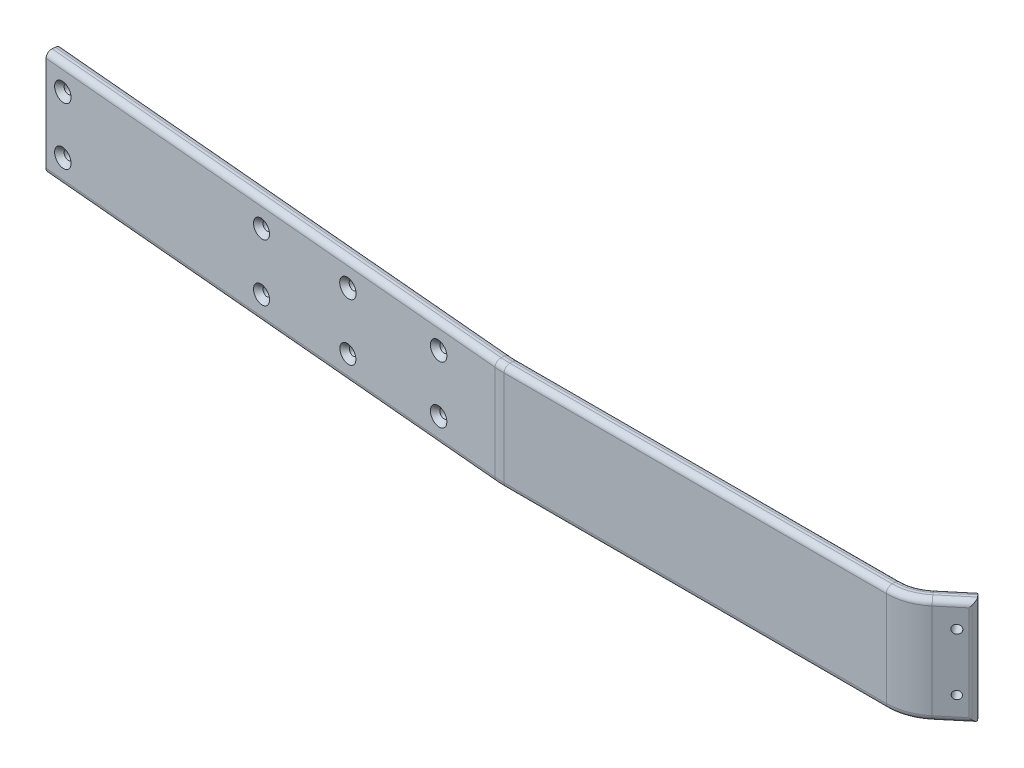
ISO-10303-21;
HEADER;
FILE_DESCRIPTION(('STEP AP214'),'2;1');
FILE_NAME('part.step','',(''),(''),'','','');
FILE_SCHEMA(('AUTOMOTIVE_DESIGN { 1 0 10303 214 1 1 1 1 }'));
ENDSEC;
DATA;
#1=APPLICATION_CONTEXT('core data for automotive mechanical design processes');
#2=APPLICATION_PROTOCOL_DEFINITION('international standard','automotive_design',2000,#1);
#3=PRODUCT_CONTEXT('',#1,'mechanical');
#4=PRODUCT('Part','Part','',(#3));
#5=PRODUCT_RELATED_PRODUCT_CATEGORY('part','',(#4));
#6=PRODUCT_DEFINITION_FORMATION('','',#4);
#7=PRODUCT_DEFINITION_CONTEXT('part definition',#1,'design');
#8=PRODUCT_DEFINITION('design','',#6,#7);
#9=PRODUCT_DEFINITION_SHAPE('','',#8);
#10=(LENGTH_UNIT() NAMED_UNIT(*) SI_UNIT(.MILLI.,.METRE.));
#11=(NAMED_UNIT(*) PLANE_ANGLE_UNIT() SI_UNIT($,.RADIAN.));
#12=(NAMED_UNIT(*) SI_UNIT($,.STERADIAN.) SOLID_ANGLE_UNIT());
#13=UNCERTAINTY_MEASURE_WITH_UNIT(LENGTH_MEASURE(1.E-05),#10,'distance_accuracy_value','');
#14=(GEOMETRIC_REPRESENTATION_CONTEXT(3) GLOBAL_UNCERTAINTY_ASSIGNED_CONTEXT((#13)) GLOBAL_UNIT_ASSIGNED_CONTEXT((#10,
#11,#12)) REPRESENTATION_CONTEXT('',''));
#15=CARTESIAN_POINT('',(0.,0.,0.));
#16=DIRECTION('',(0.,0.,1.));
#17=DIRECTION('',(1.,0.,0.));
#18=AXIS2_PLACEMENT_3D('',#15,#16,#17);
#19=CARTESIAN_POINT('',(-1399.6637338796,112.,-30.741986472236));
#20=DIRECTION('',(0.996194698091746,0.,0.0871557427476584));
#21=DIRECTION('',(0.0871557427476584,0.,-0.996194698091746));
#22=AXIS2_PLACEMENT_3D('',#19,#20,#21);
#23=PLANE('',#22);
#24=DIRECTION('',(0.,-1.,0.));
#25=VECTOR('',#24,1.);
#26=CARTESIAN_POINT('',(-1398.35639773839,112.,-45.6849069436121));
#27=LINE('',#26,#25);
#28=CARTESIAN_POINT('',(-1398.35639773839,106.,-45.6849069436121));
#29=VERTEX_POINT('',#28);
#30=CARTESIAN_POINT('',(-1398.35639773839,5.99999999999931,-45.6849069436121));
#31=VERTEX_POINT('',#30);
#32=EDGE_CURVE('E504',#29,#31,#27,.T.);
#33=ORIENTED_EDGE('',*,*,#32,.T.);
#34=CARTESIAN_POINT('',(-1398.87933219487,5.99999999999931,-39.7077387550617));
#35=DIRECTION('',(0.996194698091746,0.,0.0871557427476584));
#36=DIRECTION('',(0.0871557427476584,0.,-0.996194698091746));
#37=AXIS2_PLACEMENT_3D('',#34,#35,#36);
#38=CIRCLE('',#37,6.);
#39=CARTESIAN_POINT('',(-1398.87933219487,-6.66133814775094E-13,-39.7077387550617));
#40=VERTEX_POINT('',#39);
#41=EDGE_CURVE('E254',#31,#40,#38,.F.);
#42=ORIENTED_EDGE('',*,*,#41,.T.);
#43=DIRECTION('',(0.0871557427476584,0.,-0.996194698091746));
#44=VECTOR('',#43,1.);
#45=CARTESIAN_POINT('',(-1399.6637338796,-6.66133814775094E-13,-30.741986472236));
#46=LINE('',#45,#44);
#47=CARTESIAN_POINT('',(-1399.14079942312,-6.66133814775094E-13,-36.7191546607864));
#48=VERTEX_POINT('',#47);
#49=EDGE_CURVE('E481',#48,#40,#46,.T.);
#50=ORIENTED_EDGE('',*,*,#49,.F.);
#51=CARTESIAN_POINT('',(-1399.14079942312,5.99999999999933,-36.7191546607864));
#52=DIRECTION('',(0.996194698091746,0.,0.0871557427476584));
#53=DIRECTION('',(0.0871557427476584,0.,-0.996194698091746));
#54=AXIS2_PLACEMENT_3D('',#51,#52,#53);
#55=CIRCLE('',#54,6.);
#56=CARTESIAN_POINT('',(-1399.6637338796,5.99999999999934,-30.741986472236));
#57=VERTEX_POINT('',#56);
#58=EDGE_CURVE('E252',#48,#57,#55,.F.);
#59=ORIENTED_EDGE('',*,*,#58,.T.);
#60=DIRECTION('',(0.,-1.,0.));
#61=VECTOR('',#60,1.);
#62=CARTESIAN_POINT('',(-1399.6637338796,112.,-30.741986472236));
#63=LINE('',#62,#61);
#64=CARTESIAN_POINT('',(-1399.6637338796,106.,-30.741986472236));
#65=VERTEX_POINT('',#64);
#66=EDGE_CURVE('E495',#65,#57,#63,.T.);
#67=ORIENTED_EDGE('',*,*,#66,.F.);
#68=CARTESIAN_POINT('',(-1399.14079942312,106.,-36.7191546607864));
#69=DIRECTION('',(0.996194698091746,0.,0.0871557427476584));
#70=DIRECTION('',(0.0871557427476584,0.,-0.996194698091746));
#71=AXIS2_PLACEMENT_3D('',#68,#69,#70);
#72=CIRCLE('',#71,6.);
#73=CARTESIAN_POINT('',(-1399.14079942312,112.,-36.7191546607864));
#74=VERTEX_POINT('',#73);
#75=EDGE_CURVE('E248',#65,#74,#72,.F.);
#76=ORIENTED_EDGE('',*,*,#75,.T.);
#77=DIRECTION('',(0.0871557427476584,0.,-0.996194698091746));
#78=VECTOR('',#77,1.);
#79=CARTESIAN_POINT('',(-1399.6637338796,112.,-30.741986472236));
#80=LINE('',#79,#78);
#81=CARTESIAN_POINT('',(-1398.87933219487,112.,-39.7077387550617));
#82=VERTEX_POINT('',#81);
#83=EDGE_CURVE('E501',#74,#82,#80,.T.);
#84=ORIENTED_EDGE('',*,*,#83,.T.);
#85=CARTESIAN_POINT('',(-1398.87933219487,106.,-39.7077387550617));
#86=DIRECTION('',(0.996194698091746,0.,0.0871557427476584));
#87=DIRECTION('',(0.0871557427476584,0.,-0.996194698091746));
#88=AXIS2_PLACEMENT_3D('',#85,#86,#87);
#89=CIRCLE('',#88,6.);
#90=EDGE_CURVE('E250',#82,#29,#89,.F.);
#91=ORIENTED_EDGE('',*,*,#90,.T.);
#92=EDGE_LOOP('',(#33,#42,#50,#59,#67,#76,#84,#91));
#93=FACE_BOUND('',#92,.T.);
#94=ADVANCED_FACE('F32',(#93),#23,.F.);
#95=CARTESIAN_POINT('',(-1151.11315670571,85.9999999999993,-8.9966286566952));
#96=DIRECTION('',(0.0871557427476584,0.,-0.996194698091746));
#97=DIRECTION('',(-0.996194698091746,0.,-0.0871557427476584));
#98=AXIS2_PLACEMENT_3D('',#95,#96,#97);
#99=CYLINDRICAL_SURFACE('',#98,4.25000000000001);
#100=CARTESIAN_POINT('',(-1150.67737799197,85.9999999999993,-13.9776021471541));
#101=DIRECTION('',(-0.0871557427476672,0.,0.996194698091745));
#102=DIRECTION('',(0.996194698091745,0.,0.0871557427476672));
#103=AXIS2_PLACEMENT_3D('',#100,#101,#102);
#104=CIRCLE('',#103,4.25000000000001);
#105=CARTESIAN_POINT('',(-1146.44355052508,85.9999999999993,-13.6071902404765));
#106=VERTEX_POINT('',#105);
#107=EDGE_CURVE('E40',#106,#106,#104,.T.);
#108=ORIENTED_EDGE('',*,*,#107,.T.);
#109=EDGE_LOOP('',(#108));
#110=FACE_BOUND('',#109,.T.);
#111=CARTESIAN_POINT('',(-1149.8058205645,85.9999999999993,-23.9395491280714));
#112=DIRECTION('',(-0.0871557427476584,0.,0.996194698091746));
#113=DIRECTION('',(0.996194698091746,0.,0.0871557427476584));
#114=AXIS2_PLACEMENT_3D('',#111,#112,#113);
#115=CIRCLE('',#114,4.25000000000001);
#116=CARTESIAN_POINT('',(-1145.57199309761,85.9999999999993,-23.5691372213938));
#117=VERTEX_POINT('',#116);
#118=EDGE_CURVE('E449',#117,#117,#115,.T.);
#119=ORIENTED_EDGE('',*,*,#118,.F.);
#120=EDGE_LOOP('',(#119));
#121=FACE_BOUND('',#120,.T.);
#122=ADVANCED_FACE('F367',(#110,#121),#99,.F.);
#123=CARTESIAN_POINT('',(-1151.11315670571,25.9999999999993,-8.9966286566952));
#124=DIRECTION('',(0.0871557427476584,0.,-0.996194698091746));
#125=DIRECTION('',(-0.996194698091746,0.,-0.0871557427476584));
#126=AXIS2_PLACEMENT_3D('',#123,#124,#125);
#127=CYLINDRICAL_SURFACE('',#126,4.25000000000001);
#128=CARTESIAN_POINT('',(-1150.67737799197,25.9999999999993,-13.9776021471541));
#129=DIRECTION('',(-0.0871557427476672,0.,0.996194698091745));
#130=DIRECTION('',(0.996194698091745,0.,0.0871557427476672));
#131=AXIS2_PLACEMENT_3D('',#128,#129,#130);
#132=CIRCLE('',#131,4.25000000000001);
#133=CARTESIAN_POINT('',(-1146.44355052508,25.9999999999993,-13.6071902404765));
#134=VERTEX_POINT('',#133);
#135=EDGE_CURVE('E350',#134,#134,#132,.T.);
#136=ORIENTED_EDGE('',*,*,#135,.T.);
#137=EDGE_LOOP('',(#136));
#138=FACE_BOUND('',#137,.T.);
#139=CARTESIAN_POINT('',(-1149.8058205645,25.9999999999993,-23.9395491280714));
#140=DIRECTION('',(-0.0871557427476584,0.,0.996194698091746));
#141=DIRECTION('',(0.996194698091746,0.,0.0871557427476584));
#142=AXIS2_PLACEMENT_3D('',#139,#140,#141);
#143=CIRCLE('',#142,4.25000000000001);
#144=CARTESIAN_POINT('',(-1145.57199309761,25.9999999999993,-23.5691372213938));
#145=VERTEX_POINT('',#144);
#146=EDGE_CURVE('E453',#145,#145,#143,.T.);
#147=ORIENTED_EDGE('',*,*,#146,.F.);
#148=EDGE_LOOP('',(#147));
#149=FACE_BOUND('',#148,.T.);
#150=ADVANCED_FACE('F392',(#138,#149),#127,.F.);
#151=CARTESIAN_POINT('',(-1380.23793726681,85.9999999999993,-29.0424494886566));
#152=DIRECTION('',(0.0871557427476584,0.,-0.996194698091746));
#153=DIRECTION('',(-0.996194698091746,0.,-0.0871557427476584));
#154=AXIS2_PLACEMENT_3D('',#151,#152,#153);
#155=CYLINDRICAL_SURFACE('',#154,4.50000000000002);
#156=CARTESIAN_POINT('',(-1379.80215855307,85.9999999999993,-34.0234229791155));
#157=DIRECTION('',(-0.0871557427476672,0.,0.996194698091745));
#158=DIRECTION('',(0.996194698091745,0.,0.0871557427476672));
#159=AXIS2_PLACEMENT_3D('',#156,#157,#158);
#160=CIRCLE('',#159,4.50000000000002);
#161=CARTESIAN_POINT('',(-1375.31928241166,85.9999999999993,-33.631222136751));
#162=VERTEX_POINT('',#161);
#163=EDGE_CURVE('E11',#162,#162,#160,.T.);
#164=ORIENTED_EDGE('',*,*,#163,.T.);
#165=EDGE_LOOP('',(#164));
#166=FACE_BOUND('',#165,.T.);
#167=CARTESIAN_POINT('',(-1378.9306011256,85.9999999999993,-43.9853699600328));
#168=DIRECTION('',(-0.0871557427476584,0.,0.996194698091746));
#169=DIRECTION('',(0.996194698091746,0.,0.0871557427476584));
#170=AXIS2_PLACEMENT_3D('',#167,#168,#169);
#171=CIRCLE('',#170,4.50000000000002);
#172=CARTESIAN_POINT('',(-1374.44772498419,85.9999999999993,-43.5931691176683));
#173=VERTEX_POINT('',#172);
#174=EDGE_CURVE('E457',#173,#173,#171,.T.);
#175=ORIENTED_EDGE('',*,*,#174,.F.);
#176=EDGE_LOOP('',(#175));
#177=FACE_BOUND('',#176,.T.);
#178=ADVANCED_FACE('F401',(#166,#177),#155,.F.);
#179=CARTESIAN_POINT('',(-946.893243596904,25.9999999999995,8.87029860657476));
#180=DIRECTION('',(0.0871557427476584,0.,-0.996194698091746));
#181=DIRECTION('',(-0.996194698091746,0.,-0.0871557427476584));
#182=AXIS2_PLACEMENT_3D('',#179,#180,#181);
#183=CYLINDRICAL_SURFACE('',#182,4.49999999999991);
#184=CARTESIAN_POINT('',(-946.457464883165,25.9999999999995,3.88932511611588));
#185=DIRECTION('',(-0.0871557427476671,0.,0.996194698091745));
#186=DIRECTION('',(0.996194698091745,0.,0.0871557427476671));
#187=AXIS2_PLACEMENT_3D('',#184,#185,#186);
#188=CIRCLE('',#187,4.49999999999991);
#189=CARTESIAN_POINT('',(-941.974588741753,25.9999999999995,4.28152595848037));
#190=VERTEX_POINT('',#189);
#191=EDGE_CURVE('E356',#190,#190,#188,.T.);
#192=ORIENTED_EDGE('',*,*,#191,.T.);
#193=EDGE_LOOP('',(#192));
#194=FACE_BOUND('',#193,.T.);
#195=CARTESIAN_POINT('',(-945.585907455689,25.9999999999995,-6.07262186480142));
#196=DIRECTION('',(-0.0871557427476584,0.,0.996194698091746));
#197=DIRECTION('',(0.996194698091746,0.,0.0871557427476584));
#198=AXIS2_PLACEMENT_3D('',#195,#196,#197);
#199=CIRCLE('',#198,4.49999999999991);
#200=CARTESIAN_POINT('',(-941.103031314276,25.9999999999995,-5.68042102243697));
#201=VERTEX_POINT('',#200);
#202=EDGE_CURVE('E461',#201,#201,#199,.T.);
#203=ORIENTED_EDGE('',*,*,#202,.F.);
#204=EDGE_LOOP('',(#203));
#205=FACE_BOUND('',#204,.T.);
#206=ADVANCED_FACE('F405',(#194,#205),#183,.F.);
#207=CARTESIAN_POINT('',(-1051.49368689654,85.9999999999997,-0.281054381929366));
#208=DIRECTION('',(0.0871557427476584,0.,-0.996194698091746));
#209=DIRECTION('',(-0.996194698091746,0.,-0.0871557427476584));
#210=AXIS2_PLACEMENT_3D('',#207,#208,#209);
#211=CYLINDRICAL_SURFACE('',#210,4.50000000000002);
#212=CARTESIAN_POINT('',(-1051.0579081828,85.9999999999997,-5.26202787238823));
#213=DIRECTION('',(-0.0871557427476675,0.,0.996194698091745));
#214=DIRECTION('',(0.996194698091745,0.,0.0871557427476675));
#215=AXIS2_PLACEMENT_3D('',#212,#213,#214);
#216=CIRCLE('',#215,4.50000000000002);
#217=CARTESIAN_POINT('',(-1046.57503204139,85.9999999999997,-4.86982703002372));
#218=VERTEX_POINT('',#217);
#219=EDGE_CURVE('E362',#218,#218,#216,.T.);
#220=ORIENTED_EDGE('',*,*,#219,.T.);
#221=EDGE_LOOP('',(#220));
#222=FACE_BOUND('',#221,.T.);
#223=CARTESIAN_POINT('',(-1050.18635075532,85.9999999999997,-15.2239748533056));
#224=DIRECTION('',(-0.0871557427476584,0.,0.996194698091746));
#225=DIRECTION('',(0.996194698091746,0.,0.0871557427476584));
#226=AXIS2_PLACEMENT_3D('',#223,#224,#225);
#227=CIRCLE('',#226,4.50000000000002);
#228=CARTESIAN_POINT('',(-1045.70347461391,85.9999999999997,-14.8317740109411));
#229=VERTEX_POINT('',#228);
#230=EDGE_CURVE('E465',#229,#229,#227,.T.);
#231=ORIENTED_EDGE('',*,*,#230,.F.);
#232=EDGE_LOOP('',(#231));
#233=FACE_BOUND('',#232,.T.);
#234=ADVANCED_FACE('F409',(#222,#233),#211,.F.);
#235=CARTESIAN_POINT('',(-946.893243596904,85.9999999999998,8.87029860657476));
#236=DIRECTION('',(0.0871557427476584,0.,-0.996194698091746));
#237=DIRECTION('',(-0.996194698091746,0.,-0.0871557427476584));
#238=AXIS2_PLACEMENT_3D('',#235,#236,#237);
#239=CYLINDRICAL_SURFACE('',#238,4.49999999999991);
#240=CARTESIAN_POINT('',(-946.457464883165,85.9999999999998,3.88932511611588));
#241=DIRECTION('',(-0.0871557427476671,0.,0.996194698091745));
#242=DIRECTION('',(0.996194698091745,0.,0.0871557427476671));
#243=AXIS2_PLACEMENT_3D('',#240,#241,#242);
#244=CIRCLE('',#243,4.49999999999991);
#245=CARTESIAN_POINT('',(-941.974588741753,85.9999999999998,4.28152595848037));
#246=VERTEX_POINT('',#245);
#247=EDGE_CURVE('E359',#246,#246,#244,.T.);
#248=ORIENTED_EDGE('',*,*,#247,.T.);
#249=EDGE_LOOP('',(#248));
#250=FACE_BOUND('',#249,.T.);
#251=CARTESIAN_POINT('',(-945.585907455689,85.9999999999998,-6.07262186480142));
#252=DIRECTION('',(-0.0871557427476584,0.,0.996194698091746));
#253=DIRECTION('',(0.996194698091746,0.,0.0871557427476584));
#254=AXIS2_PLACEMENT_3D('',#251,#252,#253);
#255=CIRCLE('',#254,4.49999999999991);
#256=CARTESIAN_POINT('',(-941.103031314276,85.9999999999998,-5.68042102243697));
#257=VERTEX_POINT('',#256);
#258=EDGE_CURVE('E469',#257,#257,#255,.T.);
#259=ORIENTED_EDGE('',*,*,#258,.F.);
#260=EDGE_LOOP('',(#259));
#261=FACE_BOUND('',#260,.T.);
#262=ADVANCED_FACE('F413',(#250,#261),#239,.F.);
#263=CARTESIAN_POINT('',(-1380.23793726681,25.9999999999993,-29.0424494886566));
#264=DIRECTION('',(0.0871557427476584,0.,-0.996194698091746));
#265=DIRECTION('',(-0.996194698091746,0.,-0.0871557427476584));
#266=AXIS2_PLACEMENT_3D('',#263,#264,#265);
#267=CYLINDRICAL_SURFACE('',#266,4.50000000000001);
#268=CARTESIAN_POINT('',(-1379.80215855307,25.9999999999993,-34.0234229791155));
#269=DIRECTION('',(-0.0871557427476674,0.,0.996194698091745));
#270=DIRECTION('',(0.996194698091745,0.,0.0871557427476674));
#271=AXIS2_PLACEMENT_3D('',#268,#269,#270);
#272=CIRCLE('',#271,4.50000000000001);
#273=CARTESIAN_POINT('',(-1375.31928241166,25.9999999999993,-33.631222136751));
#274=VERTEX_POINT('',#273);
#275=EDGE_CURVE('E323',#274,#274,#272,.T.);
#276=ORIENTED_EDGE('',*,*,#275,.T.);
#277=EDGE_LOOP('',(#276));
#278=FACE_BOUND('',#277,.T.);
#279=CARTESIAN_POINT('',(-1378.9306011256,25.9999999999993,-43.9853699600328));
#280=DIRECTION('',(-0.0871557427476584,0.,0.996194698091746));
#281=DIRECTION('',(0.996194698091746,0.,0.0871557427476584));
#282=AXIS2_PLACEMENT_3D('',#279,#280,#281);
#283=CIRCLE('',#282,4.50000000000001);
#284=CARTESIAN_POINT('',(-1374.44772498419,25.9999999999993,-43.5931691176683));
#285=VERTEX_POINT('',#284);
#286=EDGE_CURVE('E473',#285,#285,#283,.T.);
#287=ORIENTED_EDGE('',*,*,#286,.F.);
#288=EDGE_LOOP('',(#287));
#289=FACE_BOUND('',#288,.T.);
#290=ADVANCED_FACE('F417',(#278,#289),#267,.F.);
#291=CARTESIAN_POINT('',(-1051.49368689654,25.9999999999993,-0.281054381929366));
#292=DIRECTION('',(0.0871557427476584,0.,-0.996194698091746));
#293=DIRECTION('',(-0.996194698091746,0.,-0.0871557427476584));
#294=AXIS2_PLACEMENT_3D('',#291,#292,#293);
#295=CYLINDRICAL_SURFACE('',#294,4.25000000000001);
#296=CARTESIAN_POINT('',(-1051.0579081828,25.9999999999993,-5.26202787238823));
#297=DIRECTION('',(-0.0871557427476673,0.,0.996194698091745));
#298=DIRECTION('',(0.996194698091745,0.,0.0871557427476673));
#299=AXIS2_PLACEMENT_3D('',#296,#297,#298);
#300=CIRCLE('',#299,4.25000000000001);
#301=CARTESIAN_POINT('',(-1046.82408071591,25.9999999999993,-4.89161596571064));
#302=VERTEX_POINT('',#301);
#303=EDGE_CURVE('E353',#302,#302,#300,.T.);
#304=ORIENTED_EDGE('',*,*,#303,.T.);
#305=EDGE_LOOP('',(#304));
#306=FACE_BOUND('',#305,.T.);
#307=CARTESIAN_POINT('',(-1050.18635075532,25.9999999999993,-15.2239748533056));
#308=DIRECTION('',(-0.0871557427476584,0.,0.996194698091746));
#309=DIRECTION('',(0.996194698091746,0.,0.0871557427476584));
#310=AXIS2_PLACEMENT_3D('',#307,#308,#309);
#311=CIRCLE('',#310,4.25000000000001);
#312=CARTESIAN_POINT('',(-1045.95252328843,25.9999999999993,-14.853562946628));
#313=VERTEX_POINT('',#312);
#314=EDGE_CURVE('E476',#313,#313,#311,.T.);
#315=ORIENTED_EDGE('',*,*,#314,.F.);
#316=EDGE_LOOP('',(#315));
#317=FACE_BOUND('',#316,.T.);
#318=ADVANCED_FACE('F421',(#306,#317),#295,.F.);
#319=CARTESIAN_POINT('',(-1399.6637338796,112.,-30.741986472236));
#320=DIRECTION('',(-0.0871557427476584,0.,0.996194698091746));
#321=DIRECTION('',(0.996194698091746,0.,0.0871557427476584));
#322=AXIS2_PLACEMENT_3D('',#319,#320,#321);
#323=PLANE('',#322);
#324=CARTESIAN_POINT('',(-1380.23793726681,25.9999999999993,-29.0424494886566));
#325=DIRECTION('',(-0.0871557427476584,0.,0.996194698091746));
#326=DIRECTION('',(0.996194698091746,0.,0.0871557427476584));
#327=AXIS2_PLACEMENT_3D('',#324,#325,#326);
#328=CIRCLE('',#327,9.50000000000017);
#329=CARTESIAN_POINT('',(-1370.77408763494,25.9999999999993,-28.2144699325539));
#330=VERTEX_POINT('',#329);
#331=EDGE_CURVE('E347',#330,#330,#328,.F.);
#332=ORIENTED_EDGE('',*,*,#331,.T.);
#333=EDGE_LOOP('',(#332));
#334=FACE_BOUND('',#333,.T.);
#335=CARTESIAN_POINT('',(-1151.11315670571,25.9999999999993,-8.99662865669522));
#336=DIRECTION('',(-0.0871557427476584,0.,0.996194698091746));
#337=DIRECTION('',(0.996194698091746,0.,0.0871557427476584));
#338=AXIS2_PLACEMENT_3D('',#335,#336,#337);
#339=CIRCLE('',#338,9.25000000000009);
#340=CARTESIAN_POINT('',(-1141.89835574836,25.9999999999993,-8.19043803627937));
#341=VERTEX_POINT('',#340);
#342=EDGE_CURVE('E344',#341,#341,#339,.F.);
#343=ORIENTED_EDGE('',*,*,#342,.T.);
#344=EDGE_LOOP('',(#343));
#345=FACE_BOUND('',#344,.T.);
#346=CARTESIAN_POINT('',(-1051.49368689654,25.9999999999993,-0.281054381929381));
#347=DIRECTION('',(-0.0871557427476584,0.,0.996194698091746));
#348=DIRECTION('',(0.996194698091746,0.,0.0871557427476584));
#349=AXIS2_PLACEMENT_3D('',#346,#347,#348);
#350=CIRCLE('',#349,9.25000000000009);
#351=CARTESIAN_POINT('',(-1042.27888593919,25.9999999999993,0.525136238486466));
#352=VERTEX_POINT('',#351);
#353=EDGE_CURVE('E341',#352,#352,#350,.F.);
#354=ORIENTED_EDGE('',*,*,#353,.T.);
#355=EDGE_LOOP('',(#354));
#356=FACE_BOUND('',#355,.T.);
#357=CARTESIAN_POINT('',(-946.893243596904,25.9999999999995,8.87029860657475));
#358=DIRECTION('',(-0.0871557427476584,0.,0.996194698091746));
#359=DIRECTION('',(0.996194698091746,0.,0.0871557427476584));
#360=AXIS2_PLACEMENT_3D('',#357,#358,#359);
#361=CIRCLE('',#360,9.49999999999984);
#362=CARTESIAN_POINT('',(-937.429393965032,25.9999999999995,9.69827816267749));
#363=VERTEX_POINT('',#362);
#364=EDGE_CURVE('E338',#363,#363,#361,.F.);
#365=ORIENTED_EDGE('',*,*,#364,.T.);
#366=EDGE_LOOP('',(#365));
#367=FACE_BOUND('',#366,.T.);
#368=CARTESIAN_POINT('',(-946.893243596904,85.9999999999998,8.87029860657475));
#369=DIRECTION('',(-0.0871557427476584,0.,0.996194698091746));
#370=DIRECTION('',(0.996194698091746,0.,0.0871557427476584));
#371=AXIS2_PLACEMENT_3D('',#368,#369,#370);
#372=CIRCLE('',#371,9.49999999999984);
#373=CARTESIAN_POINT('',(-937.429393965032,85.9999999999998,9.69827816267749));
#374=VERTEX_POINT('',#373);
#375=EDGE_CURVE('E335',#374,#374,#372,.F.);
#376=ORIENTED_EDGE('',*,*,#375,.T.);
#377=EDGE_LOOP('',(#376));
#378=FACE_BOUND('',#377,.T.);
#379=CARTESIAN_POINT('',(-1051.49368689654,85.9999999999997,-0.281054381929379));
#380=DIRECTION('',(-0.0871557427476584,0.,0.996194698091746));
#381=DIRECTION('',(0.996194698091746,0.,0.0871557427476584));
#382=AXIS2_PLACEMENT_3D('',#379,#380,#381);
#383=CIRCLE('',#382,9.50000000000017);
#384=CARTESIAN_POINT('',(-1042.02983726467,85.9999999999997,0.54692517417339));
#385=VERTEX_POINT('',#384);
#386=EDGE_CURVE('E332',#385,#385,#383,.F.);
#387=ORIENTED_EDGE('',*,*,#386,.T.);
#388=EDGE_LOOP('',(#387));
#389=FACE_BOUND('',#388,.T.);
#390=CARTESIAN_POINT('',(-1151.11315670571,85.9999999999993,-8.99662865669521));
#391=DIRECTION('',(-0.0871557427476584,0.,0.996194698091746));
#392=DIRECTION('',(0.996194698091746,0.,0.0871557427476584));
#393=AXIS2_PLACEMENT_3D('',#390,#391,#392);
#394=CIRCLE('',#393,9.25000000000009);
#395=CARTESIAN_POINT('',(-1141.89835574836,85.9999999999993,-8.19043803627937));
#396=VERTEX_POINT('',#395);
#397=EDGE_CURVE('E329',#396,#396,#394,.F.);
#398=ORIENTED_EDGE('',*,*,#397,.T.);
#399=EDGE_LOOP('',(#398));
#400=FACE_BOUND('',#399,.T.);
#401=CARTESIAN_POINT('',(-1380.23793726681,85.9999999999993,-29.0424494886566));
#402=DIRECTION('',(-0.0871557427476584,0.,0.996194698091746));
#403=DIRECTION('',(0.996194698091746,0.,0.0871557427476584));
#404=AXIS2_PLACEMENT_3D('',#401,#402,#403);
#405=CIRCLE('',#404,9.50000000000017);
#406=CARTESIAN_POINT('',(-1370.77408763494,85.9999999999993,-28.2144699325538));
#407=VERTEX_POINT('',#406);
#408=EDGE_CURVE('E326',#407,#407,#405,.F.);
#409=ORIENTED_EDGE('',*,*,#408,.T.);
#410=EDGE_LOOP('',(#409));
#411=FACE_BOUND('',#410,.T.);
#412=ORIENTED_EDGE('',*,*,#66,.T.);
#413=DIRECTION('',(-0.996194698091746,0.,-0.0871557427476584));
#414=VECTOR('',#413,1.);
#415=CARTESIAN_POINT('',(-1399.6637338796,5.99999999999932,-30.741986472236));
#416=LINE('',#415,#414);
#417=CARTESIAN_POINT('',(-881.832338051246,5.99999999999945,14.5623902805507));
#418=VERTEX_POINT('',#417);
#419=EDGE_CURVE('E268',#57,#418,#416,.F.);
#420=ORIENTED_EDGE('',*,*,#419,.T.);
#421=DIRECTION('',(0.,1.,0.));
#422=VECTOR('',#421,1.);
#423=CARTESIAN_POINT('',(-881.832338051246,112.,14.5623902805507));
#424=LINE('',#423,#422);
#425=CARTESIAN_POINT('',(-881.832338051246,106.,14.5623902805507));
#426=VERTEX_POINT('',#425);
#427=EDGE_CURVE('E498',#418,#426,#424,.T.);
#428=ORIENTED_EDGE('',*,*,#427,.T.);
#429=DIRECTION('',(0.996194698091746,0.,0.0871557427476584));
#430=VECTOR('',#429,1.);
#431=CARTESIAN_POINT('',(-1399.6637338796,106.,-30.741986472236));
#432=LINE('',#431,#430);
#433=EDGE_CURVE('E266',#426,#65,#432,.F.);
#434=ORIENTED_EDGE('',*,*,#433,.T.);
#435=EDGE_LOOP('',(#412,#420,#428,#434));
#436=FACE_BOUND('',#435,.T.);
#437=ADVANCED_FACE('F425',(#334,#345,#356,#367,#378,#389,#400,#411,#436),#323,.T.);
#438=CARTESIAN_POINT('',(-1399.6637338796,112.,-30.741986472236));
#439=DIRECTION('',(0.,1.,0.));
#440=DIRECTION('',(-0.0871557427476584,0.,0.996194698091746));
#441=AXIS2_PLACEMENT_3D('',#438,#439,#440);
#442=PLANE('',#441);
#443=DIRECTION('',(0.0871557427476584,0.,-0.996194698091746));
#444=VECTOR('',#443,1.);
#445=CARTESIAN_POINT('',(-881.832338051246,112.,14.5623902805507));
#446=LINE('',#445,#444);
#447=CARTESIAN_POINT('',(-881.30940359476,112.,8.58522209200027));
#448=VERTEX_POINT('',#447);
#449=CARTESIAN_POINT('',(-881.047936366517,112.,5.59663799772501));
#450=VERTEX_POINT('',#449);
#451=EDGE_CURVE('E492',#448,#450,#446,.T.);
#452=ORIENTED_EDGE('',*,*,#451,.T.);
#453=DIRECTION('',(0.996194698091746,0.,0.0871557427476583));
#454=VECTOR('',#453,1.);
#455=CARTESIAN_POINT('',(-1398.87933219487,112.,-39.7077387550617));
#456=LINE('',#455,#454);
#457=EDGE_CURVE('E318',#450,#82,#456,.F.);
#458=ORIENTED_EDGE('',*,*,#457,.T.);
#459=ORIENTED_EDGE('',*,*,#83,.F.);
#460=DIRECTION('',(0.996194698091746,0.,0.0871557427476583));
#461=VECTOR('',#460,1.);
#462=CARTESIAN_POINT('',(-1399.14079942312,112.,-36.7191546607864));
#463=LINE('',#462,#461);
#464=EDGE_CURVE('E316',#74,#448,#463,.T.);
#465=ORIENTED_EDGE('',*,*,#464,.T.);
#466=EDGE_LOOP('',(#452,#458,#459,#465));
#467=FACE_BOUND('',#466,.T.);
#468=ADVANCED_FACE('F429',(#467),#442,.T.);
#469=CARTESIAN_POINT('',(-1398.35639773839,112.,-45.6849069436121));
#470=DIRECTION('',(-0.0871557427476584,0.,0.996194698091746));
#471=DIRECTION('',(0.996194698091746,0.,0.0871557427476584));
#472=AXIS2_PLACEMENT_3D('',#469,#470,#471);
#473=PLANE('',#472);
#474=DIRECTION('',(0.,1.,0.));
#475=VECTOR('',#474,1.);
#476=CARTESIAN_POINT('',(-880.525001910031,112.,-0.380530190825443));
#477=LINE('',#476,#475);
#478=CARTESIAN_POINT('',(-880.525001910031,5.99999999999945,-0.380530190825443));
#479=VERTEX_POINT('',#478);
#480=CARTESIAN_POINT('',(-880.525001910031,106.,-0.380530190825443));
#481=VERTEX_POINT('',#480);
#482=EDGE_CURVE('E444',#479,#481,#477,.T.);
#483=ORIENTED_EDGE('',*,*,#482,.F.);
#484=DIRECTION('',(-0.996194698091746,0.,-0.0871557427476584));
#485=VECTOR('',#484,1.);
#486=CARTESIAN_POINT('',(-1398.35639773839,5.99999999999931,-45.6849069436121));
#487=LINE('',#486,#485);
#488=EDGE_CURVE('E246',#479,#31,#487,.T.);
#489=ORIENTED_EDGE('',*,*,#488,.T.);
#490=ORIENTED_EDGE('',*,*,#32,.F.);
#491=DIRECTION('',(0.996194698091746,0.,0.0871557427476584));
#492=VECTOR('',#491,1.);
#493=CARTESIAN_POINT('',(-880.525001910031,106.,-0.380530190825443));
#494=LINE('',#493,#492);
#495=EDGE_CURVE('E244',#29,#481,#494,.T.);
#496=ORIENTED_EDGE('',*,*,#495,.T.);
#497=EDGE_LOOP('',(#483,#489,#490,#496));
#498=FACE_BOUND('',#497,.T.);
#499=ORIENTED_EDGE('',*,*,#118,.T.);
#500=EDGE_LOOP('',(#499));
#501=FACE_BOUND('',#500,.T.);
#502=ORIENTED_EDGE('',*,*,#146,.T.);
#503=EDGE_LOOP('',(#502));
#504=FACE_BOUND('',#503,.T.);
#505=ORIENTED_EDGE('',*,*,#174,.T.);
#506=EDGE_LOOP('',(#505));
#507=FACE_BOUND('',#506,.T.);
#508=ORIENTED_EDGE('',*,*,#202,.T.);
#509=EDGE_LOOP('',(#508));
#510=FACE_BOUND('',#509,.T.);
#511=ORIENTED_EDGE('',*,*,#230,.T.);
#512=EDGE_LOOP('',(#511));
#513=FACE_BOUND('',#512,.T.);
#514=ORIENTED_EDGE('',*,*,#258,.T.);
#515=EDGE_LOOP('',(#514));
#516=FACE_BOUND('',#515,.T.);
#517=ORIENTED_EDGE('',*,*,#286,.T.);
#518=EDGE_LOOP('',(#517));
#519=FACE_BOUND('',#518,.T.);
#520=ORIENTED_EDGE('',*,*,#314,.T.);
#521=EDGE_LOOP('',(#520));
#522=FACE_BOUND('',#521,.T.);
#523=ADVANCED_FACE('F432',(#498,#501,#504,#507,#510,#513,#516,#519,#522),#473,.F.);
#524=CARTESIAN_POINT('',(-405.46142518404,-5.43918100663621E-13,56.2394447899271));
#525=DIRECTION('',(0.,-1.,0.));
#526=DIRECTION('',(0.996194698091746,0.,0.0871557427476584));
#527=AXIS2_PLACEMENT_3D('',#524,#525,#526);
#528=PLANE('',#527);
#529=ORIENTED_EDGE('',*,*,#49,.T.);
#530=DIRECTION('',(-0.996194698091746,0.,-0.0871557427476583));
#531=VECTOR('',#530,1.);
#532=CARTESIAN_POINT('',(-881.047936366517,-6.02477621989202E-13,5.59663799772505));
#533=LINE('',#532,#531);
#534=CARTESIAN_POINT('',(-881.047936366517,-6.02477621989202E-13,5.59663799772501));
#535=VERTEX_POINT('',#534);
#536=EDGE_CURVE('E258',#40,#535,#533,.F.);
#537=ORIENTED_EDGE('',*,*,#536,.T.);
#538=DIRECTION('',(-0.0871557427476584,0.,0.996194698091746));
#539=VECTOR('',#538,1.);
#540=CARTESIAN_POINT('',(-881.832338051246,-6.02477621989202E-13,14.5623902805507));
#541=LINE('',#540,#539);
#542=CARTESIAN_POINT('',(-881.30940359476,-6.02477621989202E-13,8.58522209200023));
#543=VERTEX_POINT('',#542);
#544=EDGE_CURVE('E478',#535,#543,#541,.T.);
#545=ORIENTED_EDGE('',*,*,#544,.T.);
#546=DIRECTION('',(-0.996194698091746,0.,-0.0871557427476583));
#547=VECTOR('',#546,1.);
#548=CARTESIAN_POINT('',(-404.938490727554,-5.43918100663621E-13,50.2622766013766));
#549=LINE('',#548,#547);
#550=EDGE_CURVE('E256',#543,#48,#549,.T.);
#551=ORIENTED_EDGE('',*,*,#550,.T.);
#552=EDGE_LOOP('',(#529,#537,#545,#551));
#553=FACE_BOUND('',#552,.T.);
#554=ADVANCED_FACE('F34',(#553),#528,.T.);
#555=CARTESIAN_POINT('',(-408.626585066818,112.,-19.3491139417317));
#556=DIRECTION('',(0.766044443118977,0.,-0.642787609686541));
#557=DIRECTION('',(-0.642787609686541,0.,-0.766044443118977));
#558=AXIS2_PLACEMENT_3D('',#555,#556,#557);
#559=PLANE('',#558);
#560=DIRECTION('',(-0.642787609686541,0.,-0.766044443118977));
#561=VECTOR('',#560,1.);
#562=CARTESIAN_POINT('',(-408.626585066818,-5.3804392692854E-13,-19.3491139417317));
#563=LINE('',#562,#561);
#564=CARTESIAN_POINT('',(-412.483310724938,-5.41866985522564E-13,-23.9453806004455));
#565=VERTEX_POINT('',#564);
#566=CARTESIAN_POINT('',(-414.411673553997,-5.43778514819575E-13,-26.2435139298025));
#567=VERTEX_POINT('',#566);
#568=EDGE_CURVE('E218',#565,#567,#563,.T.);
#569=ORIENTED_EDGE('',*,*,#568,.T.);
#570=DIRECTION('',(0.,-1.,0.));
#571=VECTOR('',#570,1.);
#572=CARTESIAN_POINT('',(-414.411673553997,112.,-26.2435139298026));
#573=LINE('',#572,#571);
#574=CARTESIAN_POINT('',(-414.411673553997,112.,-26.2435139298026));
#575=VERTEX_POINT('',#574);
#576=EDGE_CURVE('E314',#567,#575,#573,.F.);
#577=ORIENTED_EDGE('',*,*,#576,.T.);
#578=DIRECTION('',(-0.642787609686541,0.,-0.766044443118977));
#579=VECTOR('',#578,1.);
#580=CARTESIAN_POINT('',(-408.626585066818,112.,-19.3491139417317));
#581=LINE('',#580,#579);
#582=CARTESIAN_POINT('',(-412.483310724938,112.,-23.9453806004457));
#583=VERTEX_POINT('',#582);
#584=EDGE_CURVE('E506',#583,#575,#581,.T.);
#585=ORIENTED_EDGE('',*,*,#584,.F.);
#586=DIRECTION('',(0.,-1.,0.));
#587=VECTOR('',#586,1.);
#588=CARTESIAN_POINT('',(-412.483310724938,112.,-23.9453806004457));
#589=LINE('',#588,#587);
#590=EDGE_CURVE('E54',#583,#565,#589,.T.);
#591=ORIENTED_EDGE('',*,*,#590,.T.);
#592=EDGE_LOOP('',(#569,#577,#585,#591));
#593=FACE_BOUND('',#592,.T.);
#594=ADVANCED_FACE('F439',(#593),#559,.T.);
#595=CARTESIAN_POINT('',(-420.117251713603,85.9999999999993,-9.70729979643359));
#596=DIRECTION('',(-0.642787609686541,0.,-0.766044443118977));
#597=DIRECTION('',(-0.766044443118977,0.,0.642787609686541));
#598=AXIS2_PLACEMENT_3D('',#595,#596,#597);
#599=CYLINDRICAL_SURFACE('',#598,4.50000000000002);
#600=CARTESIAN_POINT('',(-420.117251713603,85.9999999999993,-9.70729979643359));
#601=DIRECTION('',(0.642787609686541,0.,0.766044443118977));
#602=DIRECTION('',(0.766044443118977,0.,-0.642787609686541));
#603=AXIS2_PLACEMENT_3D('',#600,#601,#602);
#604=CIRCLE('',#603,4.50000000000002);
#605=CARTESIAN_POINT('',(-416.670051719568,85.9999999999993,-12.599844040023));
#606=VERTEX_POINT('',#605);
#607=EDGE_CURVE('E512',#606,#606,#604,.T.);
#608=ORIENTED_EDGE('',*,*,#607,.T.);
#609=EDGE_LOOP('',(#608));
#610=FACE_BOUND('',#609,.T.);
#611=CARTESIAN_POINT('',(-429.759065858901,85.9999999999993,-21.1979664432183));
#612=DIRECTION('',(0.642787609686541,0.,0.766044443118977));
#613=DIRECTION('',(0.766044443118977,0.,-0.642787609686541));
#614=AXIS2_PLACEMENT_3D('',#611,#612,#613);
#615=CIRCLE('',#614,4.50000000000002);
#616=CARTESIAN_POINT('',(-426.311865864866,85.9999999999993,-24.0905106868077));
#617=VERTEX_POINT('',#616);
#618=EDGE_CURVE('E523',#617,#617,#615,.T.);
#619=ORIENTED_EDGE('',*,*,#618,.F.);
#620=EDGE_LOOP('',(#619));
#621=FACE_BOUND('',#620,.T.);
#622=ADVANCED_FACE('F765',(#610,#621),#599,.F.);
#623=CARTESIAN_POINT('',(-420.117251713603,25.9999999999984,-9.70729979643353));
#624=DIRECTION('',(-0.642787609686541,0.,-0.766044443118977));
#625=DIRECTION('',(-0.766044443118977,0.,0.642787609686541));
#626=AXIS2_PLACEMENT_3D('',#623,#624,#625);
#627=CYLINDRICAL_SURFACE('',#626,4.24999999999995);
#628=CARTESIAN_POINT('',(-420.117251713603,25.9999999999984,-9.70729979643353));
#629=DIRECTION('',(0.642787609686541,0.,0.766044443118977));
#630=DIRECTION('',(0.766044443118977,0.,-0.642787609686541));
#631=AXIS2_PLACEMENT_3D('',#628,#629,#630);
#632=CIRCLE('',#631,4.24999999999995);
#633=CARTESIAN_POINT('',(-416.861562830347,25.9999999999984,-12.4391471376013));
#634=VERTEX_POINT('',#633);
#635=EDGE_CURVE('E515',#634,#634,#632,.T.);
#636=ORIENTED_EDGE('',*,*,#635,.T.);
#637=EDGE_LOOP('',(#636));
#638=FACE_BOUND('',#637,.T.);
#639=CARTESIAN_POINT('',(-429.759065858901,25.9999999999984,-21.1979664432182));
#640=DIRECTION('',(0.642787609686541,0.,0.766044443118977));
#641=DIRECTION('',(0.766044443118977,0.,-0.642787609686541));
#642=AXIS2_PLACEMENT_3D('',#639,#640,#641);
#643=CIRCLE('',#642,4.24999999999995);
#644=CARTESIAN_POINT('',(-426.503376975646,25.9999999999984,-23.929813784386));
#645=VERTEX_POINT('',#644);
#646=EDGE_CURVE('E526',#645,#645,#643,.T.);
#647=ORIENTED_EDGE('',*,*,#646,.F.);
#648=EDGE_LOOP('',(#647));
#649=FACE_BOUND('',#648,.T.);
#650=ADVANCED_FACE('F768',(#638,#649),#627,.F.);
#651=CARTESIAN_POINT('',(-1173.13893929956,112.,622.152920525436));
#652=DIRECTION('',(0.642787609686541,0.,0.766044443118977));
#653=DIRECTION('',(0.766044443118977,0.,-0.642787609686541));
#654=AXIS2_PLACEMENT_3D('',#651,#652,#653);
#655=PLANE('',#654);
#656=ORIENTED_EDGE('',*,*,#635,.F.);
#657=EDGE_LOOP('',(#656));
#658=FACE_BOUND('',#657,.T.);
#659=ORIENTED_EDGE('',*,*,#607,.F.);
#660=EDGE_LOOP('',(#659));
#661=FACE_BOUND('',#660,.T.);
#662=DIRECTION('',(0.,-1.,0.));
#663=VECTOR('',#662,1.);
#664=CARTESIAN_POINT('',(-413.222851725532,112.,-15.4923882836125));
#665=LINE('',#664,#663);
#666=CARTESIAN_POINT('',(-413.222851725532,5.99999999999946,-15.4923882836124));
#667=VERTEX_POINT('',#666);
#668=CARTESIAN_POINT('',(-413.222851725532,106.,-15.4923882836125));
#669=VERTEX_POINT('',#668);
#670=EDGE_CURVE('E262',#667,#669,#665,.F.);
#671=ORIENTED_EDGE('',*,*,#670,.T.);
#672=DIRECTION('',(0.766044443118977,0.,-0.64278760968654));
#673=VECTOR('',#672,1.);
#674=CARTESIAN_POINT('',(-1173.13893929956,106.,622.152920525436));
#675=LINE('',#674,#673);
#676=CARTESIAN_POINT('',(-434.227309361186,106.,2.1324443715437));
#677=VERTEX_POINT('',#676);
#678=EDGE_CURVE('E264',#669,#677,#675,.F.);
#679=ORIENTED_EDGE('',*,*,#678,.T.);
#680=DIRECTION('',(0.,-1.,0.));
#681=VECTOR('',#680,1.);
#682=CARTESIAN_POINT('',(-434.227309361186,112.000000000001,2.1324443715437));
#683=LINE('',#682,#681);
#684=CARTESIAN_POINT('',(-434.227309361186,5.99999999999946,2.1324443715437));
#685=VERTEX_POINT('',#684);
#686=EDGE_CURVE('E518',#677,#685,#683,.T.);
#687=ORIENTED_EDGE('',*,*,#686,.T.);
#688=DIRECTION('',(-0.766044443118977,0.,0.64278760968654));
#689=VECTOR('',#688,1.);
#690=CARTESIAN_POINT('',(-1173.13893929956,5.99999999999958,622.152920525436));
#691=LINE('',#690,#689);
#692=EDGE_CURVE('E260',#685,#667,#691,.F.);
#693=ORIENTED_EDGE('',*,*,#692,.T.);
#694=EDGE_LOOP('',(#671,#679,#687,#693));
#695=FACE_BOUND('',#694,.T.);
#696=ADVANCED_FACE('F699',(#658,#661,#695),#655,.T.);
#697=CARTESIAN_POINT('',(-408.626585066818,-5.3804392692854E-13,-19.3491139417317));
#698=DIRECTION('',(0.,-1.,0.));
#699=DIRECTION('',(0.766044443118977,0.,-0.642787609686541));
#700=AXIS2_PLACEMENT_3D('',#697,#698,#699);
#701=PLANE('',#700);
#702=DIRECTION('',(-0.642787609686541,0.,-0.766044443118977));
#703=VECTOR('',#702,1.);
#704=CARTESIAN_POINT('',(-434.227309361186,-5.34386089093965E-13,2.1324443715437));
#705=LINE('',#704,#703);
#706=CARTESIAN_POINT('',(-438.084035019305,-5.38209147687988E-13,-2.46382228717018));
#707=VERTEX_POINT('',#706);
#708=CARTESIAN_POINT('',(-440.012397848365,-5.40120676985E-13,-4.76195561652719));
#709=VERTEX_POINT('',#708);
#710=EDGE_CURVE('E521',#707,#709,#705,.T.);
#711=ORIENTED_EDGE('',*,*,#710,.T.);
#712=DIRECTION('',(-0.766044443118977,0.,0.64278760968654));
#713=VECTOR('',#712,1.);
#714=CARTESIAN_POINT('',(-414.411673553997,-5.43778514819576E-13,-26.2435139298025));
#715=LINE('',#714,#713);
#716=EDGE_CURVE('E47',#709,#567,#715,.F.);
#717=ORIENTED_EDGE('',*,*,#716,.T.);
#718=ORIENTED_EDGE('',*,*,#568,.F.);
#719=DIRECTION('',(-0.766044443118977,0.,0.64278760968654));
#720=VECTOR('',#719,1.);
#721=CARTESIAN_POINT('',(-412.483310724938,-5.41866985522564E-13,-23.9453806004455));
#722=LINE('',#721,#720);
#723=EDGE_CURVE('E320',#565,#707,#722,.T.);
#724=ORIENTED_EDGE('',*,*,#723,.T.);
#725=EDGE_LOOP('',(#711,#717,#718,#724));
#726=FACE_BOUND('',#725,.T.);
#727=ADVANCED_FACE('F704',(#726),#701,.T.);
#728=CARTESIAN_POINT('',(-1182.78075344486,112.,610.662253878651));
#729=DIRECTION('',(0.642787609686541,0.,0.766044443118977));
#730=DIRECTION('',(0.766044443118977,0.,-0.642787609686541));
#731=AXIS2_PLACEMENT_3D('',#728,#729,#730);
#732=PLANE('',#731);
#733=DIRECTION('',(0.,-1.,0.));
#734=VECTOR('',#733,1.);
#735=CARTESIAN_POINT('',(-443.869123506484,112.000000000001,-9.35822227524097));
#736=LINE('',#735,#734);
#737=CARTESIAN_POINT('',(-443.869123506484,106.,-9.35822227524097));
#738=VERTEX_POINT('',#737);
#739=CARTESIAN_POINT('',(-443.869123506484,5.99999999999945,-9.35822227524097));
#740=VERTEX_POINT('',#739);
#741=EDGE_CURVE('E199',#738,#740,#736,.T.);
#742=ORIENTED_EDGE('',*,*,#741,.F.);
#743=DIRECTION('',(0.766044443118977,0.,-0.64278760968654));
#744=VECTOR('',#743,1.);
#745=CARTESIAN_POINT('',(-418.268399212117,106.,-30.8397805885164));
#746=LINE('',#745,#744);
#747=CARTESIAN_POINT('',(-422.86466587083,106.,-26.9830549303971));
#748=VERTEX_POINT('',#747);
#749=EDGE_CURVE('E215',#738,#748,#746,.T.);
#750=ORIENTED_EDGE('',*,*,#749,.T.);
#751=DIRECTION('',(0.,-1.,0.));
#752=VECTOR('',#751,1.);
#753=CARTESIAN_POINT('',(-422.86466587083,-5.45056783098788E-13,-26.983054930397));
#754=LINE('',#753,#752);
#755=CARTESIAN_POINT('',(-422.86466587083,5.99999999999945,-26.9830549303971));
#756=VERTEX_POINT('',#755);
#757=EDGE_CURVE('E235',#748,#756,#754,.T.);
#758=ORIENTED_EDGE('',*,*,#757,.T.);
#759=DIRECTION('',(-0.766044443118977,0.,0.64278760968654));
#760=VECTOR('',#759,1.);
#761=CARTESIAN_POINT('',(-443.869123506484,5.99999999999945,-9.35822227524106));
#762=LINE('',#761,#760);
#763=EDGE_CURVE('E217',#756,#740,#762,.T.);
#764=ORIENTED_EDGE('',*,*,#763,.T.);
#765=EDGE_LOOP('',(#742,#750,#758,#764));
#766=FACE_BOUND('',#765,.T.);
#767=ORIENTED_EDGE('',*,*,#618,.T.);
#768=EDGE_LOOP('',(#767));
#769=FACE_BOUND('',#768,.T.);
#770=ORIENTED_EDGE('',*,*,#646,.T.);
#771=EDGE_LOOP('',(#770));
#772=FACE_BOUND('',#771,.T.);
#773=ADVANCED_FACE('F212',(#766,#769,#772),#732,.F.);
#774=CARTESIAN_POINT('',(-1173.13893929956,112.,622.152920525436));
#775=DIRECTION('',(0.,1.,0.));
#776=DIRECTION('',(0.642787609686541,0.,0.766044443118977));
#777=AXIS2_PLACEMENT_3D('',#774,#775,#776);
#778=PLANE('',#777);
#779=ORIENTED_EDGE('',*,*,#584,.T.);
#780=DIRECTION('',(0.766044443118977,0.,-0.64278760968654));
#781=VECTOR('',#780,1.);
#782=CARTESIAN_POINT('',(-440.012397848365,112.,-4.76195561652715));
#783=LINE('',#782,#781);
#784=CARTESIAN_POINT('',(-440.012397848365,112.,-4.76195561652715));
#785=VERTEX_POINT('',#784);
#786=EDGE_CURVE('E238',#575,#785,#783,.F.);
#787=ORIENTED_EDGE('',*,*,#786,.T.);
#788=DIRECTION('',(0.642787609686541,0.,0.766044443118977));
#789=VECTOR('',#788,1.);
#790=CARTESIAN_POINT('',(-434.227309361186,112.,2.1324443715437));
#791=LINE('',#790,#789);
#792=CARTESIAN_POINT('',(-438.084035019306,112.,-2.46382228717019));
#793=VERTEX_POINT('',#792);
#794=EDGE_CURVE('E529',#785,#793,#791,.T.);
#795=ORIENTED_EDGE('',*,*,#794,.T.);
#796=DIRECTION('',(0.766044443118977,0.,-0.64278760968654));
#797=VECTOR('',#796,1.);
#798=CARTESIAN_POINT('',(-1176.99566495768,112.,617.556653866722));
#799=LINE('',#798,#797);
#800=EDGE_CURVE('E234',#793,#583,#799,.T.);
#801=ORIENTED_EDGE('',*,*,#800,.T.);
#802=EDGE_LOOP('',(#779,#787,#795,#801));
#803=FACE_BOUND('',#802,.T.);
#804=ADVANCED_FACE('F616',(#803),#778,.T.);
#805=CARTESIAN_POINT('',(-1401.,112.,0.));
#806=DIRECTION('',(0.,0.,1.));
#807=DIRECTION('',(1.,0.,0.));
#808=AXIS2_PLACEMENT_3D('',#805,#806,#807);
#809=PLANE('',#808);
#810=DIRECTION('',(0.,1.,0.));
#811=VECTOR('',#810,1.);
#812=CARTESIAN_POINT('',(-871.809427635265,112.,0.));
#813=LINE('',#812,#811);
#814=CARTESIAN_POINT('',(-871.809427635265,5.99999999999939,0.));
#815=VERTEX_POINT('',#814);
#816=CARTESIAN_POINT('',(-871.809427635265,106.,0.));
#817=VERTEX_POINT('',#816);
#818=EDGE_CURVE('E542',#815,#817,#813,.T.);
#819=ORIENTED_EDGE('',*,*,#818,.T.);
#820=DIRECTION('',(1.,0.,0.));
#821=VECTOR('',#820,1.);
#822=CARTESIAN_POINT('',(-469.580627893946,106.,0.));
#823=LINE('',#822,#821);
#824=CARTESIAN_POINT('',(-469.580627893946,106.,0.));
#825=VERTEX_POINT('',#824);
#826=EDGE_CURVE('E291',#817,#825,#823,.T.);
#827=ORIENTED_EDGE('',*,*,#826,.T.);
#828=DIRECTION('',(0.,-1.,0.));
#829=VECTOR('',#828,1.);
#830=CARTESIAN_POINT('',(-469.580627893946,112.000000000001,0.));
#831=LINE('',#830,#829);
#832=CARTESIAN_POINT('',(-469.580627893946,5.99999999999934,0.));
#833=VERTEX_POINT('',#832);
#834=EDGE_CURVE('E202',#825,#833,#831,.T.);
#835=ORIENTED_EDGE('',*,*,#834,.T.);
#836=DIRECTION('',(-1.,0.,0.));
#837=VECTOR('',#836,1.);
#838=CARTESIAN_POINT('',(-871.809427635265,5.99999999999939,0.));
#839=LINE('',#838,#837);
#840=EDGE_CURVE('E289',#833,#815,#839,.T.);
#841=ORIENTED_EDGE('',*,*,#840,.T.);
#842=EDGE_LOOP('',(#819,#827,#835,#841));
#843=FACE_BOUND('',#842,.T.);
#844=ADVANCED_FACE('F632',(#843),#809,.F.);
#845=CARTESIAN_POINT('',(-1401.,112.,15.));
#846=DIRECTION('',(0.,0.,1.));
#847=DIRECTION('',(1.,0.,0.));
#848=AXIS2_PLACEMENT_3D('',#845,#846,#847);
#849=PLANE('',#848);
#850=DIRECTION('',(0.,-1.,0.));
#851=VECTOR('',#850,1.);
#852=CARTESIAN_POINT('',(-469.580627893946,112.000000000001,15.));
#853=LINE('',#852,#851);
#854=CARTESIAN_POINT('',(-469.580627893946,106.,15.));
#855=VERTEX_POINT('',#854);
#856=CARTESIAN_POINT('',(-469.580627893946,5.99999999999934,15.));
#857=VERTEX_POINT('',#856);
#858=EDGE_CURVE('E551',#855,#857,#853,.T.);
#859=ORIENTED_EDGE('',*,*,#858,.F.);
#860=DIRECTION('',(1.,0.,0.));
#861=VECTOR('',#860,1.);
#862=CARTESIAN_POINT('',(-1401.,106.,15.));
#863=LINE('',#862,#861);
#864=CARTESIAN_POINT('',(-871.809427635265,106.,15.));
#865=VERTEX_POINT('',#864);
#866=EDGE_CURVE('E303',#855,#865,#863,.F.);
#867=ORIENTED_EDGE('',*,*,#866,.T.);
#868=DIRECTION('',(0.,1.,0.));
#869=VECTOR('',#868,1.);
#870=CARTESIAN_POINT('',(-871.809427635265,112.,15.));
#871=LINE('',#870,#869);
#872=CARTESIAN_POINT('',(-871.809427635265,5.99999999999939,15.));
#873=VERTEX_POINT('',#872);
#874=EDGE_CURVE('E539',#873,#865,#871,.T.);
#875=ORIENTED_EDGE('',*,*,#874,.F.);
#876=DIRECTION('',(-1.,0.,0.));
#877=VECTOR('',#876,1.);
#878=CARTESIAN_POINT('',(-1401.,5.99999999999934,15.));
#879=LINE('',#878,#877);
#880=EDGE_CURVE('E301',#873,#857,#879,.F.);
#881=ORIENTED_EDGE('',*,*,#880,.T.);
#882=EDGE_LOOP('',(#859,#867,#875,#881));
#883=FACE_BOUND('',#882,.T.);
#884=ADVANCED_FACE('F685',(#883),#849,.T.);
#885=CARTESIAN_POINT('',(-403.,-5.43918100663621E-13,15.));
#886=DIRECTION('',(0.,-1.,0.));
#887=DIRECTION('',(1.,0.,0.));
#888=AXIS2_PLACEMENT_3D('',#885,#886,#887);
#889=PLANE('',#888);
#890=DIRECTION('',(0.,0.,1.));
#891=VECTOR('',#890,1.);
#892=CARTESIAN_POINT('',(-871.809427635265,-6.01328801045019E-13,15.));
#893=LINE('',#892,#891);
#894=CARTESIAN_POINT('',(-871.809427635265,-6.01328801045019E-13,6.));
#895=VERTEX_POINT('',#894);
#896=CARTESIAN_POINT('',(-871.809427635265,-6.01328801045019E-13,9.));
#897=VERTEX_POINT('',#896);
#898=EDGE_CURVE('E536',#895,#897,#893,.T.);
#899=ORIENTED_EDGE('',*,*,#898,.F.);
#900=DIRECTION('',(-1.,0.,0.));
#901=VECTOR('',#900,1.);
#902=CARTESIAN_POINT('',(-469.580627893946,-5.52071606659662E-13,6.));
#903=LINE('',#902,#901);
#904=CARTESIAN_POINT('',(-469.580627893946,-5.52071606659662E-13,5.99999999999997));
#905=VERTEX_POINT('',#904);
#906=EDGE_CURVE('E299',#895,#905,#903,.F.);
#907=ORIENTED_EDGE('',*,*,#906,.T.);
#908=DIRECTION('',(0.,0.,-1.));
#909=VECTOR('',#908,1.);
#910=CARTESIAN_POINT('',(-469.580627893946,-5.52071606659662E-13,15.));
#911=LINE('',#910,#909);
#912=CARTESIAN_POINT('',(-469.580627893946,-5.52071606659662E-13,8.99999999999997));
#913=VERTEX_POINT('',#912);
#914=EDGE_CURVE('E548',#913,#905,#911,.T.);
#915=ORIENTED_EDGE('',*,*,#914,.F.);
#916=DIRECTION('',(-1.,0.,0.));
#917=VECTOR('',#916,1.);
#918=CARTESIAN_POINT('',(-403.,-5.43918100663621E-13,9.));
#919=LINE('',#918,#917);
#920=EDGE_CURVE('E297',#913,#897,#919,.T.);
#921=ORIENTED_EDGE('',*,*,#920,.T.);
#922=EDGE_LOOP('',(#899,#907,#915,#921));
#923=FACE_BOUND('',#922,.T.);
#924=ADVANCED_FACE('F396',(#923),#889,.T.);
#925=CARTESIAN_POINT('',(-1401.,112.,15.));
#926=DIRECTION('',(0.,1.,0.));
#927=DIRECTION('',(0.,0.,1.));
#928=AXIS2_PLACEMENT_3D('',#925,#926,#927);
#929=PLANE('',#928);
#930=DIRECTION('',(0.,0.,1.));
#931=VECTOR('',#930,1.);
#932=CARTESIAN_POINT('',(-469.580627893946,112.,15.));
#933=LINE('',#932,#931);
#934=CARTESIAN_POINT('',(-469.580627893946,112.,6.));
#935=VERTEX_POINT('',#934);
#936=CARTESIAN_POINT('',(-469.580627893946,112.,9.));
#937=VERTEX_POINT('',#936);
#938=EDGE_CURVE('E545',#935,#937,#933,.T.);
#939=ORIENTED_EDGE('',*,*,#938,.F.);
#940=DIRECTION('',(1.,0.,0.));
#941=VECTOR('',#940,1.);
#942=CARTESIAN_POINT('',(-871.809427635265,112.,6.));
#943=LINE('',#942,#941);
#944=CARTESIAN_POINT('',(-871.809427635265,112.,6.));
#945=VERTEX_POINT('',#944);
#946=EDGE_CURVE('E295',#935,#945,#943,.F.);
#947=ORIENTED_EDGE('',*,*,#946,.T.);
#948=DIRECTION('',(0.,0.,-1.));
#949=VECTOR('',#948,1.);
#950=CARTESIAN_POINT('',(-871.809427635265,112.,15.));
#951=LINE('',#950,#949);
#952=CARTESIAN_POINT('',(-871.809427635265,112.,9.));
#953=VERTEX_POINT('',#952);
#954=EDGE_CURVE('E219',#953,#945,#951,.T.);
#955=ORIENTED_EDGE('',*,*,#954,.F.);
#956=DIRECTION('',(1.,0.,0.));
#957=VECTOR('',#956,1.);
#958=CARTESIAN_POINT('',(-1401.,112.,9.));
#959=LINE('',#958,#957);
#960=EDGE_CURVE('E293',#953,#937,#959,.T.);
#961=ORIENTED_EDGE('',*,*,#960,.T.);
#962=EDGE_LOOP('',(#939,#947,#955,#961));
#963=FACE_BOUND('',#962,.T.);
#964=ADVANCED_FACE('F658',(#963),#929,.T.);
#965=CARTESIAN_POINT('',(-469.580627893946,112.,-40.));
#966=DIRECTION('',(0.,-1.,0.));
#967=DIRECTION('',(0.,0.,-1.));
#968=AXIS2_PLACEMENT_3D('',#965,#966,#967);
#969=PLANE('',#968);
#970=ORIENTED_EDGE('',*,*,#794,.F.);
#971=CARTESIAN_POINT('',(-469.580627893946,112.,-40.));
#972=DIRECTION('',(0.,-1.,0.));
#973=DIRECTION('',(0.,0.,-1.));
#974=AXIS2_PLACEMENT_3D('',#971,#972,#973);
#975=CIRCLE('',#974,46.);
#976=EDGE_CURVE('E225',#785,#935,#975,.T.);
#977=ORIENTED_EDGE('',*,*,#976,.T.);
#978=ORIENTED_EDGE('',*,*,#938,.T.);
#979=CARTESIAN_POINT('',(-469.580627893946,112.,-40.));
#980=DIRECTION('',(0.,-1.,0.));
#981=DIRECTION('',(0.,0.,-1.));
#982=AXIS2_PLACEMENT_3D('',#979,#980,#981);
#983=CIRCLE('',#982,49.);
#984=EDGE_CURVE('E207',#937,#793,#983,.F.);
#985=ORIENTED_EDGE('',*,*,#984,.T.);
#986=EDGE_LOOP('',(#970,#977,#978,#985));
#987=FACE_BOUND('',#986,.T.);
#988=ADVANCED_FACE('F675',(#987),#969,.F.);
#989=CARTESIAN_POINT('',(-469.580627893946,-6.66133814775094E-13,-40.));
#990=DIRECTION('',(0.,1.,0.));
#991=DIRECTION('',(-1.,0.,0.));
#992=AXIS2_PLACEMENT_3D('',#989,#990,#991);
#993=PLANE('',#992);
#994=ORIENTED_EDGE('',*,*,#914,.T.);
#995=CARTESIAN_POINT('',(-469.580627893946,-6.66133814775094E-13,-40.));
#996=DIRECTION('',(0.,1.,0.));
#997=DIRECTION('',(-1.,0.,0.));
#998=AXIS2_PLACEMENT_3D('',#995,#996,#997);
#999=CIRCLE('',#998,46.);
#1000=EDGE_CURVE('E311',#905,#709,#999,.T.);
#1001=ORIENTED_EDGE('',*,*,#1000,.T.);
#1002=ORIENTED_EDGE('',*,*,#710,.F.);
#1003=CARTESIAN_POINT('',(-469.580627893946,-6.66133814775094E-13,-40.));
#1004=DIRECTION('',(0.,1.,0.));
#1005=DIRECTION('',(-1.,0.,0.));
#1006=AXIS2_PLACEMENT_3D('',#1003,#1004,#1005);
#1007=CIRCLE('',#1006,49.);
#1008=EDGE_CURVE('E309',#707,#913,#1007,.F.);
#1009=ORIENTED_EDGE('',*,*,#1008,.T.);
#1010=EDGE_LOOP('',(#994,#1001,#1002,#1009));
#1011=FACE_BOUND('',#1010,.T.);
#1012=ADVANCED_FACE('F706',(#1011),#993,.F.);
#1013=CARTESIAN_POINT('',(-469.580627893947,1116.37692128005,-40.));
#1014=DIRECTION('',(0.,-1.,0.));
#1015=DIRECTION('',(1.,0.,0.));
#1016=AXIS2_PLACEMENT_3D('',#1013,#1014,#1015);
#1017=CYLINDRICAL_SURFACE('',#1016,55.);
#1018=ORIENTED_EDGE('',*,*,#686,.F.);
#1019=CARTESIAN_POINT('',(-469.580627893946,106.,-40.));
#1020=DIRECTION('',(0.,-1.,0.));
#1021=DIRECTION('',(0.,0.,-1.));
#1022=AXIS2_PLACEMENT_3D('',#1019,#1020,#1021);
#1023=CIRCLE('',#1022,55.);
#1024=EDGE_CURVE('E283',#677,#855,#1023,.T.);
#1025=ORIENTED_EDGE('',*,*,#1024,.T.);
#1026=ORIENTED_EDGE('',*,*,#858,.T.);
#1027=CARTESIAN_POINT('',(-469.580627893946,5.99999999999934,-40.));
#1028=DIRECTION('',(0.,1.,0.));
#1029=DIRECTION('',(-1.,0.,0.));
#1030=AXIS2_PLACEMENT_3D('',#1027,#1028,#1029);
#1031=CIRCLE('',#1030,55.);
#1032=EDGE_CURVE('E281',#857,#685,#1031,.T.);
#1033=ORIENTED_EDGE('',*,*,#1032,.T.);
#1034=EDGE_LOOP('',(#1018,#1025,#1026,#1033));
#1035=FACE_BOUND('',#1034,.T.);
#1036=ADVANCED_FACE('F682',(#1035),#1017,.T.);
#1037=CARTESIAN_POINT('',(-469.580627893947,1116.37692128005,-40.));
#1038=DIRECTION('',(0.,-1.,0.));
#1039=DIRECTION('',(1.,0.,0.));
#1040=AXIS2_PLACEMENT_3D('',#1037,#1038,#1039);
#1041=CYLINDRICAL_SURFACE('',#1040,40.);
#1042=ORIENTED_EDGE('',*,*,#834,.F.);
#1043=CARTESIAN_POINT('',(-469.580627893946,106.,-40.));
#1044=DIRECTION('',(0.,-1.,0.));
#1045=DIRECTION('',(0.,0.,-1.));
#1046=AXIS2_PLACEMENT_3D('',#1043,#1044,#1045);
#1047=CIRCLE('',#1046,40.);
#1048=EDGE_CURVE('E196',#825,#738,#1047,.F.);
#1049=ORIENTED_EDGE('',*,*,#1048,.T.);
#1050=ORIENTED_EDGE('',*,*,#741,.T.);
#1051=CARTESIAN_POINT('',(-469.580627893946,5.99999999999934,-40.));
#1052=DIRECTION('',(0.,1.,0.));
#1053=DIRECTION('',(-1.,0.,0.));
#1054=AXIS2_PLACEMENT_3D('',#1051,#1052,#1053);
#1055=CIRCLE('',#1054,40.);
#1056=EDGE_CURVE('E208',#740,#833,#1055,.F.);
#1057=ORIENTED_EDGE('',*,*,#1056,.T.);
#1058=EDGE_LOOP('',(#1042,#1049,#1050,#1057));
#1059=FACE_BOUND('',#1058,.T.);
#1060=ADVANCED_FACE('F198',(#1059),#1041,.F.);
#1061=CARTESIAN_POINT('',(-871.809427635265,-5.55111512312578E-13,-100.));
#1062=DIRECTION('',(0.,1.,0.));
#1063=DIRECTION('',(-1.,0.,0.));
#1064=AXIS2_PLACEMENT_3D('',#1061,#1062,#1063);
#1065=PLANE('',#1064);
#1066=ORIENTED_EDGE('',*,*,#544,.F.);
#1067=CARTESIAN_POINT('',(-871.809427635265,-5.55111512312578E-13,-100.));
#1068=DIRECTION('',(0.,1.,0.));
#1069=DIRECTION('',(-1.,0.,0.));
#1070=AXIS2_PLACEMENT_3D('',#1067,#1068,#1069);
#1071=CIRCLE('',#1070,106.);
#1072=EDGE_CURVE('E279',#535,#895,#1071,.T.);
#1073=ORIENTED_EDGE('',*,*,#1072,.T.);
#1074=ORIENTED_EDGE('',*,*,#898,.T.);
#1075=CARTESIAN_POINT('',(-871.809427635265,-5.55111512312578E-13,-100.));
#1076=DIRECTION('',(0.,1.,0.));
#1077=DIRECTION('',(-1.,0.,0.));
#1078=AXIS2_PLACEMENT_3D('',#1075,#1076,#1077);
#1079=CIRCLE('',#1078,109.);
#1080=EDGE_CURVE('E277',#897,#543,#1079,.F.);
#1081=ORIENTED_EDGE('',*,*,#1080,.T.);
#1082=EDGE_LOOP('',(#1066,#1073,#1074,#1081));
#1083=FACE_BOUND('',#1082,.T.);
#1084=ADVANCED_FACE('F713',(#1083),#1065,.F.);
#1085=CARTESIAN_POINT('',(-871.809427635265,112.,-100.));
#1086=DIRECTION('',(0.,-1.,0.));
#1087=DIRECTION('',(0.,0.,-1.));
#1088=AXIS2_PLACEMENT_3D('',#1085,#1086,#1087);
#1089=PLANE('',#1088);
#1090=ORIENTED_EDGE('',*,*,#954,.T.);
#1091=CARTESIAN_POINT('',(-871.809427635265,112.,-100.));
#1092=DIRECTION('',(0.,-1.,0.));
#1093=DIRECTION('',(0.,0.,-1.));
#1094=AXIS2_PLACEMENT_3D('',#1091,#1092,#1093);
#1095=CIRCLE('',#1094,106.);
#1096=EDGE_CURVE('E307',#945,#450,#1095,.T.);
#1097=ORIENTED_EDGE('',*,*,#1096,.T.);
#1098=ORIENTED_EDGE('',*,*,#451,.F.);
#1099=CARTESIAN_POINT('',(-871.809427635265,112.,-100.));
#1100=DIRECTION('',(0.,-1.,0.));
#1101=DIRECTION('',(0.,0.,-1.));
#1102=AXIS2_PLACEMENT_3D('',#1099,#1100,#1101);
#1103=CIRCLE('',#1102,109.);
#1104=EDGE_CURVE('E305',#448,#953,#1103,.F.);
#1105=ORIENTED_EDGE('',*,*,#1104,.T.);
#1106=EDGE_LOOP('',(#1090,#1097,#1098,#1105));
#1107=FACE_BOUND('',#1106,.T.);
#1108=ADVANCED_FACE('F661',(#1107),#1089,.F.);
#1109=CARTESIAN_POINT('',(-871.809427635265,-999.725102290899,-100.));
#1110=DIRECTION('',(0.,1.,0.));
#1111=DIRECTION('',(0.,0.,1.));
#1112=AXIS2_PLACEMENT_3D('',#1109,#1110,#1111);
#1113=CYLINDRICAL_SURFACE('',#1112,115.);
#1114=ORIENTED_EDGE('',*,*,#427,.F.);
#1115=CARTESIAN_POINT('',(-871.809427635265,5.99999999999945,-100.));
#1116=DIRECTION('',(0.,1.,0.));
#1117=DIRECTION('',(-1.,0.,0.));
#1118=AXIS2_PLACEMENT_3D('',#1115,#1116,#1117);
#1119=CIRCLE('',#1118,115.);
#1120=EDGE_CURVE('E287',#418,#873,#1119,.T.);
#1121=ORIENTED_EDGE('',*,*,#1120,.T.);
#1122=ORIENTED_EDGE('',*,*,#874,.T.);
#1123=CARTESIAN_POINT('',(-871.809427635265,106.,-100.));
#1124=DIRECTION('',(0.,-1.,0.));
#1125=DIRECTION('',(0.,0.,-1.));
#1126=AXIS2_PLACEMENT_3D('',#1123,#1124,#1125);
#1127=CIRCLE('',#1126,115.);
#1128=EDGE_CURVE('E285',#865,#426,#1127,.T.);
#1129=ORIENTED_EDGE('',*,*,#1128,.T.);
#1130=EDGE_LOOP('',(#1114,#1121,#1122,#1129));
#1131=FACE_BOUND('',#1130,.T.);
#1132=ADVANCED_FACE('F742',(#1131),#1113,.T.);
#1133=CARTESIAN_POINT('',(-871.809427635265,-999.725102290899,-100.));
#1134=DIRECTION('',(0.,1.,0.));
#1135=DIRECTION('',(0.,0.,1.));
#1136=AXIS2_PLACEMENT_3D('',#1133,#1134,#1135);
#1137=CYLINDRICAL_SURFACE('',#1136,100.);
#1138=ORIENTED_EDGE('',*,*,#818,.F.);
#1139=CARTESIAN_POINT('',(-871.809427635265,5.99999999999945,-100.));
#1140=DIRECTION('',(0.,1.,0.));
#1141=DIRECTION('',(-1.,0.,0.));
#1142=AXIS2_PLACEMENT_3D('',#1139,#1140,#1141);
#1143=CIRCLE('',#1142,100.);
#1144=EDGE_CURVE('E275',#815,#479,#1143,.F.);
#1145=ORIENTED_EDGE('',*,*,#1144,.T.);
#1146=ORIENTED_EDGE('',*,*,#482,.T.);
#1147=CARTESIAN_POINT('',(-871.809427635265,106.,-100.));
#1148=DIRECTION('',(0.,-1.,0.));
#1149=DIRECTION('',(0.,0.,-1.));
#1150=AXIS2_PLACEMENT_3D('',#1147,#1148,#1149);
#1151=CIRCLE('',#1150,100.);
#1152=EDGE_CURVE('E273',#481,#817,#1151,.F.);
#1153=ORIENTED_EDGE('',*,*,#1152,.T.);
#1154=EDGE_LOOP('',(#1138,#1145,#1146,#1153));
#1155=FACE_BOUND('',#1154,.T.);
#1156=ADVANCED_FACE('F645',(#1155),#1137,.F.);
#1157=CARTESIAN_POINT('',(-1398.87933219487,5.99999999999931,-39.7077387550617));
#1158=DIRECTION('',(0.996194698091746,0.,0.0871557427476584));
#1159=DIRECTION('',(0.0871557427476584,0.,-0.996194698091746));
#1160=AXIS2_PLACEMENT_3D('',#1157,#1158,#1159);
#1161=CYLINDRICAL_SURFACE('',#1160,6.);
#1162=ORIENTED_EDGE('',*,*,#41,.F.);
#1163=ORIENTED_EDGE('',*,*,#488,.F.);
#1164=CARTESIAN_POINT('',(-881.047936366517,5.9999999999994,5.59663799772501));
#1165=DIRECTION('',(0.996194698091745,0.,0.0871557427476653));
#1166=DIRECTION('',(0.0871557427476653,0.,-0.996194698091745));
#1167=AXIS2_PLACEMENT_3D('',#1164,#1165,#1166);
#1168=CIRCLE('',#1167,6.);
#1169=EDGE_CURVE('E555',#535,#479,#1168,.T.);
#1170=ORIENTED_EDGE('',*,*,#1169,.F.);
#1171=ORIENTED_EDGE('',*,*,#536,.F.);
#1172=EDGE_LOOP('',(#1162,#1163,#1170,#1171));
#1173=FACE_BOUND('',#1172,.T.);
#1174=ADVANCED_FACE('F727',(#1173),#1161,.T.);
#1175=CARTESIAN_POINT('',(-871.809427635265,5.99999999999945,-100.));
#1176=DIRECTION('',(0.,1.,0.));
#1177=DIRECTION('',(-1.,0.,0.));
#1178=AXIS2_PLACEMENT_3D('',#1175,#1176,#1177);
#1179=TOROIDAL_SURFACE('',#1178,106.,6.);
#1180=ORIENTED_EDGE('',*,*,#1169,.T.);
#1181=ORIENTED_EDGE('',*,*,#1144,.F.);
#1182=CARTESIAN_POINT('',(-871.809427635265,5.99999999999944,6.00000000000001));
#1183=DIRECTION('',(1.,0.,0.));
#1184=DIRECTION('',(0.,0.,-1.));
#1185=AXIS2_PLACEMENT_3D('',#1182,#1183,#1184);
#1186=CIRCLE('',#1185,6.);
#1187=EDGE_CURVE('E558',#895,#815,#1186,.T.);
#1188=ORIENTED_EDGE('',*,*,#1187,.F.);
#1189=ORIENTED_EDGE('',*,*,#1072,.F.);
#1190=EDGE_LOOP('',(#1180,#1181,#1188,#1189));
#1191=FACE_BOUND('',#1190,.T.);
#1192=ADVANCED_FACE('F642',(#1191),#1179,.T.);
#1193=CARTESIAN_POINT('',(-1398.87933219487,106.,-39.7077387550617));
#1194=DIRECTION('',(-0.996194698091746,0.,-0.0871557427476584));
#1195=DIRECTION('',(-0.0871557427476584,0.,0.996194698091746));
#1196=AXIS2_PLACEMENT_3D('',#1193,#1194,#1195);
#1197=CYLINDRICAL_SURFACE('',#1196,6.);
#1198=ORIENTED_EDGE('',*,*,#90,.F.);
#1199=ORIENTED_EDGE('',*,*,#457,.F.);
#1200=CARTESIAN_POINT('',(-881.047936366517,106.,5.59663799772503));
#1201=DIRECTION('',(0.996194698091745,0.,0.087155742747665));
#1202=DIRECTION('',(0.087155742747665,0.,-0.996194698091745));
#1203=AXIS2_PLACEMENT_3D('',#1200,#1201,#1202);
#1204=CIRCLE('',#1203,6.);
#1205=EDGE_CURVE('E561',#481,#450,#1204,.T.);
#1206=ORIENTED_EDGE('',*,*,#1205,.F.);
#1207=ORIENTED_EDGE('',*,*,#495,.F.);
#1208=EDGE_LOOP('',(#1198,#1199,#1206,#1207));
#1209=FACE_BOUND('',#1208,.T.);
#1210=ADVANCED_FACE('F731',(#1209),#1197,.T.);
#1211=CARTESIAN_POINT('',(-1401.,5.99999999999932,6.));
#1212=DIRECTION('',(1.,0.,0.));
#1213=DIRECTION('',(0.,1.,0.));
#1214=AXIS2_PLACEMENT_3D('',#1211,#1212,#1213);
#1215=CYLINDRICAL_SURFACE('',#1214,6.);
#1216=ORIENTED_EDGE('',*,*,#1187,.T.);
#1217=ORIENTED_EDGE('',*,*,#840,.F.);
#1218=CARTESIAN_POINT('',(-469.580627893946,5.99999999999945,6.));
#1219=DIRECTION('',(1.,0.,0.));
#1220=DIRECTION('',(0.,0.,-1.));
#1221=AXIS2_PLACEMENT_3D('',#1218,#1219,#1220);
#1222=CIRCLE('',#1221,6.);
#1223=EDGE_CURVE('E564',#905,#833,#1222,.T.);
#1224=ORIENTED_EDGE('',*,*,#1223,.F.);
#1225=ORIENTED_EDGE('',*,*,#906,.F.);
#1226=EDGE_LOOP('',(#1216,#1217,#1224,#1225));
#1227=FACE_BOUND('',#1226,.T.);
#1228=ADVANCED_FACE('F636',(#1227),#1215,.T.);
#1229=CARTESIAN_POINT('',(-871.809427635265,106.,-100.));
#1230=DIRECTION('',(0.,-1.,0.));
#1231=DIRECTION('',(0.,0.,-1.));
#1232=AXIS2_PLACEMENT_3D('',#1229,#1230,#1231);
#1233=TOROIDAL_SURFACE('',#1232,106.,6.);
#1234=ORIENTED_EDGE('',*,*,#1205,.T.);
#1235=ORIENTED_EDGE('',*,*,#1096,.F.);
#1236=CARTESIAN_POINT('',(-871.809427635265,106.,6.));
#1237=DIRECTION('',(1.,0.,0.));
#1238=DIRECTION('',(0.,0.,-1.));
#1239=AXIS2_PLACEMENT_3D('',#1236,#1237,#1238);
#1240=CIRCLE('',#1239,6.);
#1241=EDGE_CURVE('E567',#817,#945,#1240,.T.);
#1242=ORIENTED_EDGE('',*,*,#1241,.F.);
#1243=ORIENTED_EDGE('',*,*,#1152,.F.);
#1244=EDGE_LOOP('',(#1234,#1235,#1242,#1243));
#1245=FACE_BOUND('',#1244,.T.);
#1246=ADVANCED_FACE('F651',(#1245),#1233,.T.);
#1247=CARTESIAN_POINT('',(-469.580627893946,5.99999999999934,-40.));
#1248=DIRECTION('',(0.,1.,0.));
#1249=DIRECTION('',(-1.,0.,0.));
#1250=AXIS2_PLACEMENT_3D('',#1247,#1248,#1249);
#1251=TOROIDAL_SURFACE('',#1250,46.,6.);
#1252=ORIENTED_EDGE('',*,*,#1223,.T.);
#1253=ORIENTED_EDGE('',*,*,#1056,.F.);
#1254=CARTESIAN_POINT('',(-440.012397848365,5.99999999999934,-4.7619556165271));
#1255=DIRECTION('',(0.766044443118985,0.,-0.642787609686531));
#1256=DIRECTION('',(-0.642787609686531,0.,-0.766044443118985));
#1257=AXIS2_PLACEMENT_3D('',#1254,#1255,#1256);
#1258=CIRCLE('',#1257,6.);
#1259=EDGE_CURVE('E570',#709,#740,#1258,.T.);
#1260=ORIENTED_EDGE('',*,*,#1259,.F.);
#1261=ORIENTED_EDGE('',*,*,#1000,.F.);
#1262=EDGE_LOOP('',(#1252,#1253,#1260,#1261));
#1263=FACE_BOUND('',#1262,.T.);
#1264=ADVANCED_FACE('F628',(#1263),#1251,.T.);
#1265=CARTESIAN_POINT('',(-1401.,106.,6.));
#1266=DIRECTION('',(-1.,0.,0.));
#1267=DIRECTION('',(0.,0.,1.));
#1268=AXIS2_PLACEMENT_3D('',#1265,#1266,#1267);
#1269=CYLINDRICAL_SURFACE('',#1268,6.);
#1270=ORIENTED_EDGE('',*,*,#1241,.T.);
#1271=ORIENTED_EDGE('',*,*,#946,.F.);
#1272=CARTESIAN_POINT('',(-469.580627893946,106.,6.));
#1273=DIRECTION('',(1.,0.,0.));
#1274=DIRECTION('',(0.,0.,-1.));
#1275=AXIS2_PLACEMENT_3D('',#1272,#1273,#1274);
#1276=CIRCLE('',#1275,6.);
#1277=EDGE_CURVE('E573',#825,#935,#1276,.T.);
#1278=ORIENTED_EDGE('',*,*,#1277,.F.);
#1279=ORIENTED_EDGE('',*,*,#826,.F.);
#1280=EDGE_LOOP('',(#1270,#1271,#1278,#1279));
#1281=FACE_BOUND('',#1280,.T.);
#1282=ADVANCED_FACE('F654',(#1281),#1269,.T.);
#1283=CARTESIAN_POINT('',(-1178.92402778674,5.99999999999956,615.258520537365));
#1284=DIRECTION('',(0.766044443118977,0.,-0.64278760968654));
#1285=DIRECTION('',(-0.64278760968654,0.,-0.766044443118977));
#1286=AXIS2_PLACEMENT_3D('',#1283,#1284,#1285);
#1287=CYLINDRICAL_SURFACE('',#1286,6.);
#1288=ORIENTED_EDGE('',*,*,#1259,.T.);
#1289=ORIENTED_EDGE('',*,*,#763,.F.);
#1290=CARTESIAN_POINT('',(-419.007940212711,5.99999999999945,-22.3867882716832));
#1291=DIRECTION('',(0.541675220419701,0.707106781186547,-0.454519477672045));
#1292=DIRECTION('',(0.541675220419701,-0.707106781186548,-0.454519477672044));
#1293=AXIS2_PLACEMENT_3D('',#1290,#1291,#1292);
#1294=ELLIPSE('',#1293,8.48528137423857,6.);
#1295=EDGE_CURVE('E228',#567,#756,#1294,.T.);
#1296=ORIENTED_EDGE('',*,*,#1295,.F.);
#1297=ORIENTED_EDGE('',*,*,#716,.F.);
#1298=EDGE_LOOP('',(#1288,#1289,#1296,#1297));
#1299=FACE_BOUND('',#1298,.T.);
#1300=ADVANCED_FACE('F624',(#1299),#1287,.T.);
#1301=CARTESIAN_POINT('',(-469.580627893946,106.,-40.));
#1302=DIRECTION('',(0.,-1.,0.));
#1303=DIRECTION('',(0.,0.,-1.));
#1304=AXIS2_PLACEMENT_3D('',#1301,#1302,#1303);
#1305=TOROIDAL_SURFACE('',#1304,46.,6.);
#1306=ORIENTED_EDGE('',*,*,#1277,.T.);
#1307=ORIENTED_EDGE('',*,*,#976,.F.);
#1308=CARTESIAN_POINT('',(-440.012397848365,106.,-4.76195561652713));
#1309=DIRECTION('',(0.766044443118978,0.,-0.64278760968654));
#1310=DIRECTION('',(-0.64278760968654,0.,-0.766044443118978));
#1311=AXIS2_PLACEMENT_3D('',#1308,#1309,#1310);
#1312=CIRCLE('',#1311,6.);
#1313=EDGE_CURVE('E223',#738,#785,#1312,.T.);
#1314=ORIENTED_EDGE('',*,*,#1313,.F.);
#1315=ORIENTED_EDGE('',*,*,#1048,.F.);
#1316=EDGE_LOOP('',(#1306,#1307,#1314,#1315));
#1317=FACE_BOUND('',#1316,.T.);
#1318=ADVANCED_FACE('F224',(#1317),#1305,.T.);
#1319=CARTESIAN_POINT('',(-419.007940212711,112.,-22.3867882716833));
#1320=DIRECTION('',(0.,1.,0.));
#1321=DIRECTION('',(0.,0.,1.));
#1322=AXIS2_PLACEMENT_3D('',#1319,#1320,#1321);
#1323=CYLINDRICAL_SURFACE('',#1322,6.);
#1324=ORIENTED_EDGE('',*,*,#1295,.T.);
#1325=ORIENTED_EDGE('',*,*,#757,.F.);
#1326=CARTESIAN_POINT('',(-419.007940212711,106.,-22.3867882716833));
#1327=DIRECTION('',(-0.541675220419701,0.707106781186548,0.454519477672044));
#1328=DIRECTION('',(0.541675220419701,0.707106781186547,-0.454519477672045));
#1329=AXIS2_PLACEMENT_3D('',#1326,#1327,#1328);
#1330=ELLIPSE('',#1329,8.48528137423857,6.);
#1331=EDGE_CURVE('E229',#575,#748,#1330,.T.);
#1332=ORIENTED_EDGE('',*,*,#1331,.F.);
#1333=ORIENTED_EDGE('',*,*,#576,.F.);
#1334=EDGE_LOOP('',(#1324,#1325,#1332,#1333));
#1335=FACE_BOUND('',#1334,.T.);
#1336=ADVANCED_FACE('F622',(#1335),#1323,.T.);
#1337=CARTESIAN_POINT('',(-1178.92402778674,106.,615.258520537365));
#1338=DIRECTION('',(-0.766044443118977,0.,0.64278760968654));
#1339=DIRECTION('',(0.64278760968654,0.,0.766044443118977));
#1340=AXIS2_PLACEMENT_3D('',#1337,#1338,#1339);
#1341=CYLINDRICAL_SURFACE('',#1340,6.);
#1342=ORIENTED_EDGE('',*,*,#1313,.T.);
#1343=ORIENTED_EDGE('',*,*,#786,.F.);
#1344=ORIENTED_EDGE('',*,*,#1331,.T.);
#1345=ORIENTED_EDGE('',*,*,#749,.F.);
#1346=EDGE_LOOP('',(#1342,#1343,#1344,#1345));
#1347=FACE_BOUND('',#1346,.T.);
#1348=ADVANCED_FACE('F231',(#1347),#1341,.T.);
#1349=CARTESIAN_POINT('',(-404.938490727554,5.99999999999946,50.2622766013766));
#1350=DIRECTION('',(-0.996194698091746,0.,-0.0871557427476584));
#1351=DIRECTION('',(-0.0871557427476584,0.,0.996194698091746));
#1352=AXIS2_PLACEMENT_3D('',#1349,#1350,#1351);
#1353=CYLINDRICAL_SURFACE('',#1352,6.);
#1354=ORIENTED_EDGE('',*,*,#58,.F.);
#1355=ORIENTED_EDGE('',*,*,#550,.F.);
#1356=CARTESIAN_POINT('',(-881.30940359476,5.9999999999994,8.58522209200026));
#1357=DIRECTION('',(0.996194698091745,0.,0.087155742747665));
#1358=DIRECTION('',(0.0871557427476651,0.,-0.996194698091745));
#1359=AXIS2_PLACEMENT_3D('',#1356,#1357,#1358);
#1360=CIRCLE('',#1359,6.);
#1361=EDGE_CURVE('E578',#418,#543,#1360,.T.);
#1362=ORIENTED_EDGE('',*,*,#1361,.F.);
#1363=ORIENTED_EDGE('',*,*,#419,.F.);
#1364=EDGE_LOOP('',(#1354,#1355,#1362,#1363));
#1365=FACE_BOUND('',#1364,.T.);
#1366=ADVANCED_FACE('F722',(#1365),#1353,.T.);
#1367=CARTESIAN_POINT('',(-871.809427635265,5.99999999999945,-100.));
#1368=DIRECTION('',(0.,1.,0.));
#1369=DIRECTION('',(-1.,0.,0.));
#1370=AXIS2_PLACEMENT_3D('',#1367,#1368,#1369);
#1371=TOROIDAL_SURFACE('',#1370,109.,6.);
#1372=ORIENTED_EDGE('',*,*,#1361,.T.);
#1373=ORIENTED_EDGE('',*,*,#1080,.F.);
#1374=CARTESIAN_POINT('',(-871.809427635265,5.99999999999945,9.));
#1375=DIRECTION('',(1.,0.,0.));
#1376=DIRECTION('',(0.,0.,-1.));
#1377=AXIS2_PLACEMENT_3D('',#1374,#1375,#1376);
#1378=CIRCLE('',#1377,6.);
#1379=EDGE_CURVE('E581',#873,#897,#1378,.T.);
#1380=ORIENTED_EDGE('',*,*,#1379,.F.);
#1381=ORIENTED_EDGE('',*,*,#1120,.F.);
#1382=EDGE_LOOP('',(#1372,#1373,#1380,#1381));
#1383=FACE_BOUND('',#1382,.T.);
#1384=ADVANCED_FACE('F715',(#1383),#1371,.T.);
#1385=CARTESIAN_POINT('',(-1399.14079942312,106.,-36.7191546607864));
#1386=DIRECTION('',(0.996194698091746,0.,0.0871557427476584));
#1387=DIRECTION('',(0.0871557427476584,0.,-0.996194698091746));
#1388=AXIS2_PLACEMENT_3D('',#1385,#1386,#1387);
#1389=CYLINDRICAL_SURFACE('',#1388,6.);
#1390=ORIENTED_EDGE('',*,*,#75,.F.);
#1391=ORIENTED_EDGE('',*,*,#433,.F.);
#1392=CARTESIAN_POINT('',(-881.30940359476,106.,8.58522209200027));
#1393=DIRECTION('',(0.996194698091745,0.,0.0871557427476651));
#1394=DIRECTION('',(0.0871557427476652,0.,-0.996194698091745));
#1395=AXIS2_PLACEMENT_3D('',#1392,#1393,#1394);
#1396=CIRCLE('',#1395,6.);
#1397=EDGE_CURVE('E584',#448,#426,#1396,.T.);
#1398=ORIENTED_EDGE('',*,*,#1397,.F.);
#1399=ORIENTED_EDGE('',*,*,#464,.F.);
#1400=EDGE_LOOP('',(#1390,#1391,#1398,#1399));
#1401=FACE_BOUND('',#1400,.T.);
#1402=ADVANCED_FACE('F738',(#1401),#1389,.T.);
#1403=CARTESIAN_POINT('',(-403.,5.99999999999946,9.));
#1404=DIRECTION('',(-1.,0.,0.));
#1405=DIRECTION('',(0.,-1.,0.));
#1406=AXIS2_PLACEMENT_3D('',#1403,#1404,#1405);
#1407=CYLINDRICAL_SURFACE('',#1406,6.);
#1408=ORIENTED_EDGE('',*,*,#1379,.T.);
#1409=ORIENTED_EDGE('',*,*,#920,.F.);
#1410=CARTESIAN_POINT('',(-469.580627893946,5.99999999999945,9.));
#1411=DIRECTION('',(1.,0.,0.));
#1412=DIRECTION('',(0.,0.,-1.));
#1413=AXIS2_PLACEMENT_3D('',#1410,#1411,#1412);
#1414=CIRCLE('',#1413,6.);
#1415=EDGE_CURVE('E587',#857,#913,#1414,.T.);
#1416=ORIENTED_EDGE('',*,*,#1415,.F.);
#1417=ORIENTED_EDGE('',*,*,#880,.F.);
#1418=EDGE_LOOP('',(#1408,#1409,#1416,#1417));
#1419=FACE_BOUND('',#1418,.T.);
#1420=ADVANCED_FACE('F690',(#1419),#1407,.T.);
#1421=CARTESIAN_POINT('',(-871.809427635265,106.,-100.));
#1422=DIRECTION('',(0.,-1.,0.));
#1423=DIRECTION('',(0.,0.,-1.));
#1424=AXIS2_PLACEMENT_3D('',#1421,#1422,#1423);
#1425=TOROIDAL_SURFACE('',#1424,109.,6.);
#1426=ORIENTED_EDGE('',*,*,#1397,.T.);
#1427=ORIENTED_EDGE('',*,*,#1128,.F.);
#1428=CARTESIAN_POINT('',(-871.809427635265,106.,9.));
#1429=DIRECTION('',(1.,0.,0.));
#1430=DIRECTION('',(0.,0.,-1.));
#1431=AXIS2_PLACEMENT_3D('',#1428,#1429,#1430);
#1432=CIRCLE('',#1431,6.);
#1433=EDGE_CURVE('E590',#953,#865,#1432,.T.);
#1434=ORIENTED_EDGE('',*,*,#1433,.F.);
#1435=ORIENTED_EDGE('',*,*,#1104,.F.);
#1436=EDGE_LOOP('',(#1426,#1427,#1434,#1435));
#1437=FACE_BOUND('',#1436,.T.);
#1438=ADVANCED_FACE('F666',(#1437),#1425,.T.);
#1439=CARTESIAN_POINT('',(-469.580627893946,5.99999999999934,-40.));
#1440=DIRECTION('',(0.,1.,0.));
#1441=DIRECTION('',(-1.,0.,0.));
#1442=AXIS2_PLACEMENT_3D('',#1439,#1440,#1441);
#1443=TOROIDAL_SURFACE('',#1442,49.,6.);
#1444=ORIENTED_EDGE('',*,*,#1415,.T.);
#1445=ORIENTED_EDGE('',*,*,#1008,.F.);
#1446=CARTESIAN_POINT('',(-438.084035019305,5.99999999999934,-2.4638222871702));
#1447=DIRECTION('',(0.766044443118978,0.,-0.64278760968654));
#1448=DIRECTION('',(-0.64278760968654,0.,-0.766044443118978));
#1449=AXIS2_PLACEMENT_3D('',#1446,#1447,#1448);
#1450=CIRCLE('',#1449,6.);
#1451=EDGE_CURVE('E593',#685,#707,#1450,.T.);
#1452=ORIENTED_EDGE('',*,*,#1451,.F.);
#1453=ORIENTED_EDGE('',*,*,#1032,.F.);
#1454=EDGE_LOOP('',(#1444,#1445,#1452,#1453));
#1455=FACE_BOUND('',#1454,.T.);
#1456=ADVANCED_FACE('F696',(#1455),#1443,.T.);
#1457=CARTESIAN_POINT('',(-1401.,106.,9.));
#1458=DIRECTION('',(1.,0.,0.));
#1459=DIRECTION('',(0.,0.,-1.));
#1460=AXIS2_PLACEMENT_3D('',#1457,#1458,#1459);
#1461=CYLINDRICAL_SURFACE('',#1460,6.);
#1462=ORIENTED_EDGE('',*,*,#1433,.T.);
#1463=ORIENTED_EDGE('',*,*,#866,.F.);
#1464=CARTESIAN_POINT('',(-469.580627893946,106.,9.));
#1465=DIRECTION('',(1.,0.,0.));
#1466=DIRECTION('',(0.,0.,-1.));
#1467=AXIS2_PLACEMENT_3D('',#1464,#1465,#1466);
#1468=CIRCLE('',#1467,6.);
#1469=EDGE_CURVE('E596',#937,#855,#1468,.T.);
#1470=ORIENTED_EDGE('',*,*,#1469,.F.);
#1471=ORIENTED_EDGE('',*,*,#960,.F.);
#1472=EDGE_LOOP('',(#1462,#1463,#1470,#1471));
#1473=FACE_BOUND('',#1472,.T.);
#1474=ADVANCED_FACE('F672',(#1473),#1461,.T.);
#1475=CARTESIAN_POINT('',(-412.483310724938,5.99999999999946,-23.9453806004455));
#1476=DIRECTION('',(-0.766044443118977,0.,0.64278760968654));
#1477=DIRECTION('',(0.64278760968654,0.,0.766044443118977));
#1478=AXIS2_PLACEMENT_3D('',#1475,#1476,#1477);
#1479=CYLINDRICAL_SURFACE('',#1478,6.);
#1480=ORIENTED_EDGE('',*,*,#1451,.T.);
#1481=ORIENTED_EDGE('',*,*,#723,.F.);
#1482=CARTESIAN_POINT('',(-417.079577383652,5.99999999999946,-20.0886549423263));
#1483=DIRECTION('',(-0.541675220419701,-0.707106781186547,0.454519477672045));
#1484=DIRECTION('',(-0.541675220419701,0.707106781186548,0.454519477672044));
#1485=AXIS2_PLACEMENT_3D('',#1482,#1483,#1484);
#1486=ELLIPSE('',#1485,8.48528137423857,6.);
#1487=EDGE_CURVE('E599',#667,#565,#1486,.F.);
#1488=ORIENTED_EDGE('',*,*,#1487,.F.);
#1489=ORIENTED_EDGE('',*,*,#692,.F.);
#1490=EDGE_LOOP('',(#1480,#1481,#1488,#1489));
#1491=FACE_BOUND('',#1490,.T.);
#1492=ADVANCED_FACE('F702',(#1491),#1479,.T.);
#1493=CARTESIAN_POINT('',(-469.580627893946,106.,-40.));
#1494=DIRECTION('',(0.,-1.,0.));
#1495=DIRECTION('',(0.,0.,-1.));
#1496=AXIS2_PLACEMENT_3D('',#1493,#1494,#1495);
#1497=TOROIDAL_SURFACE('',#1496,49.,6.);
#1498=ORIENTED_EDGE('',*,*,#1469,.T.);
#1499=ORIENTED_EDGE('',*,*,#1024,.F.);
#1500=CARTESIAN_POINT('',(-438.084035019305,106.,-2.46382228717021));
#1501=DIRECTION('',(0.766044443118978,0.,-0.642787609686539));
#1502=DIRECTION('',(-0.642787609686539,0.,-0.766044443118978));
#1503=AXIS2_PLACEMENT_3D('',#1500,#1501,#1502);
#1504=CIRCLE('',#1503,6.);
#1505=EDGE_CURVE('E602',#793,#677,#1504,.T.);
#1506=ORIENTED_EDGE('',*,*,#1505,.F.);
#1507=ORIENTED_EDGE('',*,*,#984,.F.);
#1508=EDGE_LOOP('',(#1498,#1499,#1506,#1507));
#1509=FACE_BOUND('',#1508,.T.);
#1510=ADVANCED_FACE('F677',(#1509),#1497,.T.);
#1511=CARTESIAN_POINT('',(-417.079577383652,112.,-20.0886549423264));
#1512=DIRECTION('',(0.,-1.,0.));
#1513=DIRECTION('',(0.,0.,-1.));
#1514=AXIS2_PLACEMENT_3D('',#1511,#1512,#1513);
#1515=CYLINDRICAL_SURFACE('',#1514,6.);
#1516=ORIENTED_EDGE('',*,*,#1487,.T.);
#1517=ORIENTED_EDGE('',*,*,#590,.F.);
#1518=CARTESIAN_POINT('',(-417.079577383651,106.,-20.0886549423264));
#1519=DIRECTION('',(0.541675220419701,-0.707106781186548,-0.454519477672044));
#1520=DIRECTION('',(-0.541675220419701,-0.707106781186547,0.454519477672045));
#1521=AXIS2_PLACEMENT_3D('',#1518,#1519,#1520);
#1522=ELLIPSE('',#1521,8.48528137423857,6.);
#1523=EDGE_CURVE('E605',#669,#583,#1522,.F.);
#1524=ORIENTED_EDGE('',*,*,#1523,.F.);
#1525=ORIENTED_EDGE('',*,*,#670,.F.);
#1526=EDGE_LOOP('',(#1516,#1517,#1524,#1525));
#1527=FACE_BOUND('',#1526,.T.);
#1528=ADVANCED_FACE('F613',(#1527),#1515,.T.);
#1529=CARTESIAN_POINT('',(-1176.99566495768,106.,617.556653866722));
#1530=DIRECTION('',(0.766044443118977,0.,-0.64278760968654));
#1531=DIRECTION('',(-0.64278760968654,0.,-0.766044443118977));
#1532=AXIS2_PLACEMENT_3D('',#1529,#1530,#1531);
#1533=CYLINDRICAL_SURFACE('',#1532,6.);
#1534=ORIENTED_EDGE('',*,*,#1505,.T.);
#1535=ORIENTED_EDGE('',*,*,#678,.F.);
#1536=ORIENTED_EDGE('',*,*,#1523,.T.);
#1537=ORIENTED_EDGE('',*,*,#800,.F.);
#1538=EDGE_LOOP('',(#1534,#1535,#1536,#1537));
#1539=FACE_BOUND('',#1538,.T.);
#1540=ADVANCED_FACE('F610',(#1539),#1533,.T.);
#1541=CARTESIAN_POINT('',(-1379.80215855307,25.9999999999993,-34.0234229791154));
#1542=DIRECTION('',(-0.0871557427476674,0.,0.996194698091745));
#1543=DIRECTION('',(0.996194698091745,0.,0.0871557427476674));
#1544=AXIS2_PLACEMENT_3D('',#1541,#1542,#1543);
#1545=CONICAL_SURFACE('',#1544,4.50000000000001,0.785398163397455);
#1546=ORIENTED_EDGE('',*,*,#331,.F.);
#1547=EDGE_LOOP('',(#1546));
#1548=FACE_BOUND('',#1547,.T.);
#1549=ORIENTED_EDGE('',*,*,#275,.F.);
#1550=EDGE_LOOP('',(#1549));
#1551=FACE_BOUND('',#1550,.T.);
#1552=ADVANCED_FACE('F1014',(#1548,#1551),#1545,.F.);
#1553=CARTESIAN_POINT('',(-1150.67737799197,25.9999999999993,-13.977602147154));
#1554=DIRECTION('',(-0.0871557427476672,0.,0.996194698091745));
#1555=DIRECTION('',(0.996194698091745,0.,0.0871557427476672));
#1556=AXIS2_PLACEMENT_3D('',#1553,#1554,#1555);
#1557=CONICAL_SURFACE('',#1556,4.25000000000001,0.785398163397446);
#1558=ORIENTED_EDGE('',*,*,#342,.F.);
#1559=EDGE_LOOP('',(#1558));
#1560=FACE_BOUND('',#1559,.T.);
#1561=ORIENTED_EDGE('',*,*,#135,.F.);
#1562=EDGE_LOOP('',(#1561));
#1563=FACE_BOUND('',#1562,.T.);
#1564=ADVANCED_FACE('F1079',(#1560,#1563),#1557,.F.);
#1565=CARTESIAN_POINT('',(-1051.0579081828,25.9999999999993,-5.26202787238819));
#1566=DIRECTION('',(-0.0871557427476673,0.,0.996194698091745));
#1567=DIRECTION('',(0.996194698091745,0.,0.0871557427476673));
#1568=AXIS2_PLACEMENT_3D('',#1565,#1566,#1567);
#1569=CONICAL_SURFACE('',#1568,4.25000000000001,0.785398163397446);
#1570=ORIENTED_EDGE('',*,*,#353,.F.);
#1571=EDGE_LOOP('',(#1570));
#1572=FACE_BOUND('',#1571,.T.);
#1573=ORIENTED_EDGE('',*,*,#303,.F.);
#1574=EDGE_LOOP('',(#1573));
#1575=FACE_BOUND('',#1574,.T.);
#1576=ADVANCED_FACE('F1089',(#1572,#1575),#1569,.F.);
#1577=CARTESIAN_POINT('',(-946.457464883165,25.9999999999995,3.88932511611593));
#1578=DIRECTION('',(-0.0871557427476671,0.,0.996194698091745));
#1579=DIRECTION('',(0.996194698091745,0.,0.0871557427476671));
#1580=AXIS2_PLACEMENT_3D('',#1577,#1578,#1579);
#1581=CONICAL_SURFACE('',#1580,4.49999999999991,0.785398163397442);
#1582=ORIENTED_EDGE('',*,*,#364,.F.);
#1583=EDGE_LOOP('',(#1582));
#1584=FACE_BOUND('',#1583,.T.);
#1585=ORIENTED_EDGE('',*,*,#191,.F.);
#1586=EDGE_LOOP('',(#1585));
#1587=FACE_BOUND('',#1586,.T.);
#1588=ADVANCED_FACE('F1099',(#1584,#1587),#1581,.F.);
#1589=CARTESIAN_POINT('',(-946.457464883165,85.9999999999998,3.88932511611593));
#1590=DIRECTION('',(-0.0871557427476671,0.,0.996194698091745));
#1591=DIRECTION('',(0.996194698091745,0.,0.0871557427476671));
#1592=AXIS2_PLACEMENT_3D('',#1589,#1590,#1591);
#1593=CONICAL_SURFACE('',#1592,4.49999999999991,0.785398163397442);
#1594=ORIENTED_EDGE('',*,*,#375,.F.);
#1595=EDGE_LOOP('',(#1594));
#1596=FACE_BOUND('',#1595,.T.);
#1597=ORIENTED_EDGE('',*,*,#247,.F.);
#1598=EDGE_LOOP('',(#1597));
#1599=FACE_BOUND('',#1598,.T.);
#1600=ADVANCED_FACE('F382',(#1596,#1599),#1593,.F.);
#1601=CARTESIAN_POINT('',(-1051.0579081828,85.9999999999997,-5.26202787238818));
#1602=DIRECTION('',(-0.0871557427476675,0.,0.996194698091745));
#1603=DIRECTION('',(0.996194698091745,0.,0.0871557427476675));
#1604=AXIS2_PLACEMENT_3D('',#1601,#1602,#1603);
#1605=CONICAL_SURFACE('',#1604,4.50000000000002,0.785398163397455);
#1606=ORIENTED_EDGE('',*,*,#386,.F.);
#1607=EDGE_LOOP('',(#1606));
#1608=FACE_BOUND('',#1607,.T.);
#1609=ORIENTED_EDGE('',*,*,#219,.F.);
#1610=EDGE_LOOP('',(#1609));
#1611=FACE_BOUND('',#1610,.T.);
#1612=ADVANCED_FACE('F373',(#1608,#1611),#1605,.F.);
#1613=CARTESIAN_POINT('',(-1150.67737799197,85.9999999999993,-13.977602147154));
#1614=DIRECTION('',(-0.0871557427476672,0.,0.996194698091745));
#1615=DIRECTION('',(0.996194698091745,0.,0.0871557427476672));
#1616=AXIS2_PLACEMENT_3D('',#1613,#1614,#1615);
#1617=CONICAL_SURFACE('',#1616,4.25000000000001,0.785398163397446);
#1618=ORIENTED_EDGE('',*,*,#397,.F.);
#1619=EDGE_LOOP('',(#1618));
#1620=FACE_BOUND('',#1619,.T.);
#1621=ORIENTED_EDGE('',*,*,#107,.F.);
#1622=EDGE_LOOP('',(#1621));
#1623=FACE_BOUND('',#1622,.T.);
#1624=ADVANCED_FACE('F370',(#1620,#1623),#1617,.F.);
#1625=CARTESIAN_POINT('',(-1379.80215855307,85.9999999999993,-34.0234229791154));
#1626=DIRECTION('',(-0.0871557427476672,0.,0.996194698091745));
#1627=DIRECTION('',(0.996194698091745,0.,0.0871557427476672));
#1628=AXIS2_PLACEMENT_3D('',#1625,#1626,#1627);
#1629=CONICAL_SURFACE('',#1628,4.50000000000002,0.785398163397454);
#1630=ORIENTED_EDGE('',*,*,#408,.F.);
#1631=EDGE_LOOP('',(#1630));
#1632=FACE_BOUND('',#1631,.T.);
#1633=ORIENTED_EDGE('',*,*,#163,.F.);
#1634=EDGE_LOOP('',(#1633));
#1635=FACE_BOUND('',#1634,.T.);
#1636=ADVANCED_FACE('F372',(#1632,#1635),#1629,.F.);
#1637=CLOSED_SHELL('',(#94,#122,#150,#178,#206,#234,#262,#290,#318,#437,#468,#523,#554,#594,
#622,#650,#696,#727,#773,#804,#844,#884,#924,#964,#988,#1012,#1036,#1060,#1084,#1108,#1132,
#1156,#1174,#1192,#1210,#1228,#1246,#1264,#1282,#1300,#1318,#1336,#1348,#1366,#1384,#1402,#1420,
#1438,#1456,#1474,#1492,#1510,#1528,#1540,#1552,#1564,#1576,#1588,#1600,#1612,#1624,#1636));
#1638=MANIFOLD_SOLID_BREP('B2',#1637);
#1639=ADVANCED_BREP_SHAPE_REPRESENTATION('',(#18,#1638),#14);
#1640=SHAPE_DEFINITION_REPRESENTATION(#9,#1639);
ENDSEC;
END-ISO-10303-21;
